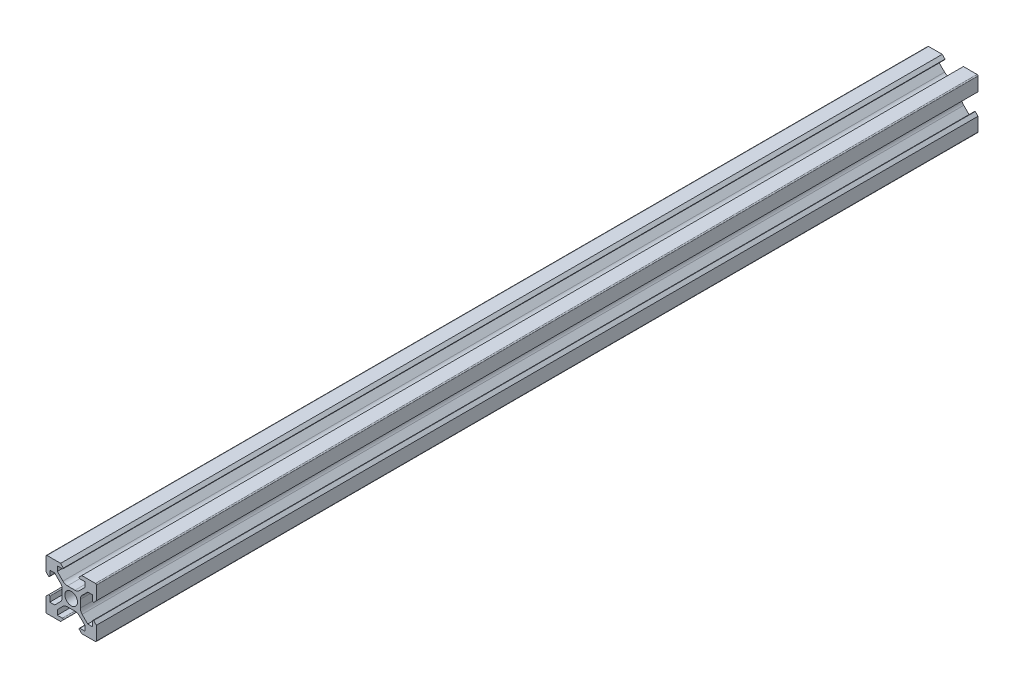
ISO-10303-21;
HEADER;
FILE_DESCRIPTION(('STEP AP214'),'2;1');
FILE_NAME('part.step','',(''),(''),'','','');
FILE_SCHEMA(('AUTOMOTIVE_DESIGN { 1 0 10303 214 1 1 1 1 }'));
ENDSEC;
DATA;
#1=APPLICATION_CONTEXT('core data for automotive mechanical design processes');
#2=APPLICATION_PROTOCOL_DEFINITION('international standard','automotive_design',2000,#1);
#3=PRODUCT_CONTEXT('',#1,'mechanical');
#4=PRODUCT('Part','Part','',(#3));
#5=PRODUCT_RELATED_PRODUCT_CATEGORY('part','',(#4));
#6=PRODUCT_DEFINITION_FORMATION('','',#4);
#7=PRODUCT_DEFINITION_CONTEXT('part definition',#1,'design');
#8=PRODUCT_DEFINITION('design','',#6,#7);
#9=PRODUCT_DEFINITION_SHAPE('','',#8);
#10=(LENGTH_UNIT() NAMED_UNIT(*) SI_UNIT(.MILLI.,.METRE.));
#11=(NAMED_UNIT(*) PLANE_ANGLE_UNIT() SI_UNIT($,.RADIAN.));
#12=(NAMED_UNIT(*) SI_UNIT($,.STERADIAN.) SOLID_ANGLE_UNIT());
#13=UNCERTAINTY_MEASURE_WITH_UNIT(LENGTH_MEASURE(1.E-05),#10,'distance_accuracy_value','');
#14=(GEOMETRIC_REPRESENTATION_CONTEXT(3) GLOBAL_UNCERTAINTY_ASSIGNED_CONTEXT((#13)) GLOBAL_UNIT_ASSIGNED_CONTEXT((#10,
#11,#12)) REPRESENTATION_CONTEXT('',''));
#15=CARTESIAN_POINT('',(0.,0.,0.));
#16=DIRECTION('',(0.,0.,1.));
#17=DIRECTION('',(1.,0.,0.));
#18=AXIS2_PLACEMENT_3D('',#15,#16,#17);
#19=CARTESIAN_POINT('',(-3.49999999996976,8.8999999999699,231.));
#20=DIRECTION('',(0.,0.,-1.));
#21=DIRECTION('',(-1.,0.,0.));
#22=AXIS2_PLACEMENT_3D('',#19,#20,#21);
#23=CYLINDRICAL_SURFACE('',#22,0.4);
#24=CARTESIAN_POINT('',(-3.49999999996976,8.8999999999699,231.));
#25=DIRECTION('',(0.,0.,-1.));
#26=DIRECTION('',(-1.,0.,0.));
#27=AXIS2_PLACEMENT_3D('',#24,#25,#26);
#28=CIRCLE('',#27,0.4);
#29=CARTESIAN_POINT('',(-3.09999999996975,8.89999999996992,231.));
#30=VERTEX_POINT('',#29);
#31=CARTESIAN_POINT('',(-3.4999999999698,8.49999999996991,231.));
#32=VERTEX_POINT('',#31);
#33=EDGE_CURVE('E960',#30,#32,#28,.T.);
#34=ORIENTED_EDGE('',*,*,#33,.T.);
#35=DIRECTION('',(0.,0.,1.));
#36=VECTOR('',#35,1.);
#37=CARTESIAN_POINT('',(-3.49999999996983,8.49999999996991,231.));
#38=LINE('',#37,#36);
#39=CARTESIAN_POINT('',(-3.4999999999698,8.49999999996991,-119.));
#40=VERTEX_POINT('',#39);
#41=EDGE_CURVE('E802',#32,#40,#38,.F.);
#42=ORIENTED_EDGE('',*,*,#41,.T.);
#43=CARTESIAN_POINT('',(-3.49999999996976,8.8999999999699,-119.));
#44=DIRECTION('',(0.,0.,-1.));
#45=DIRECTION('',(-1.,0.,0.));
#46=AXIS2_PLACEMENT_3D('',#43,#44,#45);
#47=CIRCLE('',#46,0.4);
#48=CARTESIAN_POINT('',(-3.09999999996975,8.89999999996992,-119.));
#49=VERTEX_POINT('',#48);
#50=EDGE_CURVE('E20',#40,#49,#47,.F.);
#51=ORIENTED_EDGE('',*,*,#50,.T.);
#52=DIRECTION('',(0.,0.,1.));
#53=VECTOR('',#52,1.);
#54=CARTESIAN_POINT('',(-3.09999999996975,8.89999999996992,231.));
#55=LINE('',#54,#53);
#56=EDGE_CURVE('E931',#49,#30,#55,.T.);
#57=ORIENTED_EDGE('',*,*,#56,.T.);
#58=EDGE_LOOP('',(#34,#42,#51,#57));
#59=FACE_BOUND('',#58,.T.);
#60=ADVANCED_FACE('F17',(#59),#23,.T.);
#61=CARTESIAN_POINT('',(-3.09999999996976,8.89999999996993,231.));
#62=DIRECTION('',(-0.707106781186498,-0.707106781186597,0.));
#63=DIRECTION('',(0.707106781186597,-0.707106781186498,0.));
#64=AXIS2_PLACEMENT_3D('',#61,#62,#63);
#65=PLANE('',#64);
#66=DIRECTION('',(0.,0.,1.));
#67=VECTOR('',#66,1.);
#68=CARTESIAN_POINT('',(-4.2,9.99999999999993,231.));
#69=LINE('',#68,#67);
#70=CARTESIAN_POINT('',(-4.2,9.99999999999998,-119.));
#71=VERTEX_POINT('',#70);
#72=CARTESIAN_POINT('',(-4.2,9.99999999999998,231.));
#73=VERTEX_POINT('',#72);
#74=EDGE_CURVE('E799',#71,#73,#69,.T.);
#75=ORIENTED_EDGE('',*,*,#74,.T.);
#76=DIRECTION('',(0.707106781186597,-0.707106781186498,0.));
#77=VECTOR('',#76,1.);
#78=CARTESIAN_POINT('',(-3.09999999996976,8.89999999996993,231.));
#79=LINE('',#78,#77);
#80=EDGE_CURVE('E926',#30,#73,#79,.F.);
#81=ORIENTED_EDGE('',*,*,#80,.F.);
#82=ORIENTED_EDGE('',*,*,#56,.F.);
#83=DIRECTION('',(0.707106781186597,-0.707106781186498,0.));
#84=VECTOR('',#83,1.);
#85=CARTESIAN_POINT('',(-3.09999999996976,8.89999999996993,-119.));
#86=LINE('',#85,#84);
#87=EDGE_CURVE('E923',#71,#49,#86,.T.);
#88=ORIENTED_EDGE('',*,*,#87,.F.);
#89=EDGE_LOOP('',(#75,#81,#82,#88));
#90=FACE_BOUND('',#89,.T.);
#91=ADVANCED_FACE('F1025',(#90),#65,.F.);
#92=CARTESIAN_POINT('',(-9.6,9.6,231.));
#93=DIRECTION('',(0.,0.,-1.));
#94=DIRECTION('',(-1.,0.,0.));
#95=AXIS2_PLACEMENT_3D('',#92,#93,#94);
#96=CYLINDRICAL_SURFACE('',#95,0.400000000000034);
#97=CARTESIAN_POINT('',(-9.6,9.6,231.));
#98=DIRECTION('',(0.,0.,-1.));
#99=DIRECTION('',(-1.,0.,0.));
#100=AXIS2_PLACEMENT_3D('',#97,#98,#99);
#101=CIRCLE('',#100,0.400000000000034);
#102=CARTESIAN_POINT('',(-10.,9.60000000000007,231.));
#103=VERTEX_POINT('',#102);
#104=CARTESIAN_POINT('',(-9.6,10.,231.));
#105=VERTEX_POINT('',#104);
#106=EDGE_CURVE('E378',#103,#105,#101,.T.);
#107=ORIENTED_EDGE('',*,*,#106,.T.);
#108=DIRECTION('',(0.,0.,1.));
#109=VECTOR('',#108,1.);
#110=CARTESIAN_POINT('',(-9.6,10.,231.));
#111=LINE('',#110,#109);
#112=CARTESIAN_POINT('',(-9.6,10.,-119.));
#113=VERTEX_POINT('',#112);
#114=EDGE_CURVE('E793',#105,#113,#111,.F.);
#115=ORIENTED_EDGE('',*,*,#114,.T.);
#116=CARTESIAN_POINT('',(-9.6,9.6,-119.));
#117=DIRECTION('',(0.,0.,-1.));
#118=DIRECTION('',(-1.,0.,0.));
#119=AXIS2_PLACEMENT_3D('',#116,#117,#118);
#120=CIRCLE('',#119,0.400000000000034);
#121=CARTESIAN_POINT('',(-10.,9.60000000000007,-119.));
#122=VERTEX_POINT('',#121);
#123=EDGE_CURVE('E925',#113,#122,#120,.F.);
#124=ORIENTED_EDGE('',*,*,#123,.T.);
#125=DIRECTION('',(0.,0.,-1.));
#126=VECTOR('',#125,1.);
#127=CARTESIAN_POINT('',(-10.,9.60000000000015,231.));
#128=LINE('',#127,#126);
#129=EDGE_CURVE('E388',#122,#103,#128,.F.);
#130=ORIENTED_EDGE('',*,*,#129,.T.);
#131=EDGE_LOOP('',(#107,#115,#124,#130));
#132=FACE_BOUND('',#131,.T.);
#133=ADVANCED_FACE('F1868',(#132),#96,.T.);
#134=CARTESIAN_POINT('',(-8.89999999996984,3.09999999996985,231.));
#135=DIRECTION('',(0.70710678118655,0.707106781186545,0.));
#136=DIRECTION('',(-0.707106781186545,0.70710678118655,0.));
#137=AXIS2_PLACEMENT_3D('',#134,#135,#136);
#138=PLANE('',#137);
#139=DIRECTION('',(0.,0.,-1.));
#140=VECTOR('',#139,1.);
#141=CARTESIAN_POINT('',(-8.89999999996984,3.09999999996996,231.));
#142=LINE('',#141,#140);
#143=CARTESIAN_POINT('',(-8.89999999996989,3.09999999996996,231.));
#144=VERTEX_POINT('',#143);
#145=CARTESIAN_POINT('',(-8.89999999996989,3.09999999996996,-119.));
#146=VERTEX_POINT('',#145);
#147=EDGE_CURVE('E375',#144,#146,#142,.T.);
#148=ORIENTED_EDGE('',*,*,#147,.F.);
#149=DIRECTION('',(-0.707106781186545,0.70710678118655,0.));
#150=VECTOR('',#149,1.);
#151=CARTESIAN_POINT('',(-8.89999999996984,3.09999999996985,231.));
#152=LINE('',#151,#150);
#153=CARTESIAN_POINT('',(-10.,4.2,231.));
#154=VERTEX_POINT('',#153);
#155=EDGE_CURVE('E369',#154,#144,#152,.F.);
#156=ORIENTED_EDGE('',*,*,#155,.F.);
#157=DIRECTION('',(0.,0.,-1.));
#158=VECTOR('',#157,1.);
#159=CARTESIAN_POINT('',(-10.,4.2,231.));
#160=LINE('',#159,#158);
#161=CARTESIAN_POINT('',(-10.,4.2,-119.));
#162=VERTEX_POINT('',#161);
#163=EDGE_CURVE('E372',#154,#162,#160,.T.);
#164=ORIENTED_EDGE('',*,*,#163,.T.);
#165=DIRECTION('',(-0.707106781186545,0.70710678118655,0.));
#166=VECTOR('',#165,1.);
#167=CARTESIAN_POINT('',(-8.89999999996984,3.09999999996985,-119.));
#168=LINE('',#167,#166);
#169=EDGE_CURVE('E377',#146,#162,#168,.T.);
#170=ORIENTED_EDGE('',*,*,#169,.F.);
#171=EDGE_LOOP('',(#148,#156,#164,#170));
#172=FACE_BOUND('',#171,.T.);
#173=ADVANCED_FACE('F371',(#172),#138,.F.);
#174=CARTESIAN_POINT('',(-8.89999999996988,3.49999999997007,231.));
#175=DIRECTION('',(0.,0.,-1.));
#176=DIRECTION('',(-1.,0.,0.));
#177=AXIS2_PLACEMENT_3D('',#174,#175,#176);
#178=CYLINDRICAL_SURFACE('',#177,0.400000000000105);
#179=CARTESIAN_POINT('',(-8.89999999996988,3.49999999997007,231.));
#180=DIRECTION('',(0.,0.,-1.));
#181=DIRECTION('',(-1.,0.,0.));
#182=AXIS2_PLACEMENT_3D('',#179,#180,#181);
#183=CIRCLE('',#182,0.400000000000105);
#184=CARTESIAN_POINT('',(-8.49999999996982,3.49999999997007,231.));
#185=VERTEX_POINT('',#184);
#186=EDGE_CURVE('E958',#185,#144,#183,.T.);
#187=ORIENTED_EDGE('',*,*,#186,.T.);
#188=ORIENTED_EDGE('',*,*,#147,.T.);
#189=CARTESIAN_POINT('',(-8.89999999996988,3.49999999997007,-119.));
#190=DIRECTION('',(0.,0.,-1.));
#191=DIRECTION('',(-1.,0.,0.));
#192=AXIS2_PLACEMENT_3D('',#189,#190,#191);
#193=CIRCLE('',#192,0.400000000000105);
#194=CARTESIAN_POINT('',(-8.49999999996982,3.49999999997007,-119.));
#195=VERTEX_POINT('',#194);
#196=EDGE_CURVE('E920',#146,#195,#193,.F.);
#197=ORIENTED_EDGE('',*,*,#196,.T.);
#198=DIRECTION('',(0.,0.,1.));
#199=VECTOR('',#198,1.);
#200=CARTESIAN_POINT('',(-8.49999999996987,3.49999999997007,231.));
#201=LINE('',#200,#199);
#202=EDGE_CURVE('E387',#195,#185,#201,.T.);
#203=ORIENTED_EDGE('',*,*,#202,.T.);
#204=EDGE_LOOP('',(#187,#188,#197,#203));
#205=FACE_BOUND('',#204,.T.);
#206=ADVANCED_FACE('F1126',(#205),#178,.T.);
#207=CARTESIAN_POINT('',(-8.89999999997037,-3.49999999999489,231.));
#208=DIRECTION('',(0.,0.,-1.));
#209=DIRECTION('',(-1.,0.,0.));
#210=AXIS2_PLACEMENT_3D('',#207,#208,#209);
#211=CYLINDRICAL_SURFACE('',#210,0.399999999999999);
#212=CARTESIAN_POINT('',(-8.89999999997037,-3.49999999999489,231.));
#213=DIRECTION('',(0.,0.,-1.));
#214=DIRECTION('',(-1.,0.,0.));
#215=AXIS2_PLACEMENT_3D('',#212,#213,#214);
#216=CIRCLE('',#215,0.399999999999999);
#217=CARTESIAN_POINT('',(-8.8999999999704,-3.09999999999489,231.));
#218=VERTEX_POINT('',#217);
#219=CARTESIAN_POINT('',(-8.49999999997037,-3.49999999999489,231.));
#220=VERTEX_POINT('',#219);
#221=EDGE_CURVE('E955',#218,#220,#216,.T.);
#222=ORIENTED_EDGE('',*,*,#221,.T.);
#223=DIRECTION('',(0.,0.,1.));
#224=VECTOR('',#223,1.);
#225=CARTESIAN_POINT('',(-8.49999999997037,-3.49999999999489,231.));
#226=LINE('',#225,#224);
#227=CARTESIAN_POINT('',(-8.49999999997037,-3.49999999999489,-119.));
#228=VERTEX_POINT('',#227);
#229=EDGE_CURVE('E742',#220,#228,#226,.F.);
#230=ORIENTED_EDGE('',*,*,#229,.T.);
#231=CARTESIAN_POINT('',(-8.89999999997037,-3.49999999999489,-119.));
#232=DIRECTION('',(0.,0.,-1.));
#233=DIRECTION('',(-1.,0.,0.));
#234=AXIS2_PLACEMENT_3D('',#231,#232,#233);
#235=CIRCLE('',#234,0.399999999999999);
#236=CARTESIAN_POINT('',(-8.8999999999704,-3.09999999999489,-119.));
#237=VERTEX_POINT('',#236);
#238=EDGE_CURVE('E957',#228,#237,#235,.F.);
#239=ORIENTED_EDGE('',*,*,#238,.T.);
#240=DIRECTION('',(0.,0.,1.));
#241=VECTOR('',#240,1.);
#242=CARTESIAN_POINT('',(-8.8999999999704,-3.09999999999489,231.));
#243=LINE('',#242,#241);
#244=EDGE_CURVE('E914',#237,#218,#243,.T.);
#245=ORIENTED_EDGE('',*,*,#244,.T.);
#246=EDGE_LOOP('',(#222,#230,#239,#245));
#247=FACE_BOUND('',#246,.T.);
#248=ADVANCED_FACE('F1362',(#247),#211,.T.);
#249=CARTESIAN_POINT('',(-8.8999999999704,-3.09999999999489,231.));
#250=DIRECTION('',(0.707106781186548,-0.707106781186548,0.));
#251=DIRECTION('',(0.707106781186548,0.707106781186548,0.));
#252=AXIS2_PLACEMENT_3D('',#249,#250,#251);
#253=PLANE('',#252);
#254=DIRECTION('',(0.,0.,-1.));
#255=VECTOR('',#254,1.);
#256=CARTESIAN_POINT('',(-10.0000000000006,-4.20000000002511,231.));
#257=LINE('',#256,#255);
#258=CARTESIAN_POINT('',(-10.0000000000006,-4.20000000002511,-119.));
#259=VERTEX_POINT('',#258);
#260=CARTESIAN_POINT('',(-10.0000000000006,-4.20000000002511,231.));
#261=VERTEX_POINT('',#260);
#262=EDGE_CURVE('E739',#259,#261,#257,.F.);
#263=ORIENTED_EDGE('',*,*,#262,.T.);
#264=DIRECTION('',(0.707106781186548,0.707106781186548,0.));
#265=VECTOR('',#264,1.);
#266=CARTESIAN_POINT('',(-8.8999999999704,-3.09999999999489,231.));
#267=LINE('',#266,#265);
#268=EDGE_CURVE('E910',#218,#261,#267,.F.);
#269=ORIENTED_EDGE('',*,*,#268,.F.);
#270=ORIENTED_EDGE('',*,*,#244,.F.);
#271=DIRECTION('',(0.707106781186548,0.707106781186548,0.));
#272=VECTOR('',#271,1.);
#273=CARTESIAN_POINT('',(-8.8999999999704,-3.09999999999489,-119.));
#274=LINE('',#273,#272);
#275=EDGE_CURVE('E906',#259,#237,#274,.T.);
#276=ORIENTED_EDGE('',*,*,#275,.F.);
#277=EDGE_LOOP('',(#263,#269,#270,#276));
#278=FACE_BOUND('',#277,.T.);
#279=ADVANCED_FACE('F1356',(#278),#253,.F.);
#280=CARTESIAN_POINT('',(-9.60000000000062,-9.60000000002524,231.));
#281=DIRECTION('',(0.,0.,-1.));
#282=DIRECTION('',(-1.,0.,0.));
#283=AXIS2_PLACEMENT_3D('',#280,#281,#282);
#284=CYLINDRICAL_SURFACE('',#283,0.399999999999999);
#285=CARTESIAN_POINT('',(-9.60000000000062,-9.60000000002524,231.));
#286=DIRECTION('',(0.,0.,-1.));
#287=DIRECTION('',(-1.,0.,0.));
#288=AXIS2_PLACEMENT_3D('',#285,#286,#287);
#289=CIRCLE('',#288,0.399999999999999);
#290=CARTESIAN_POINT('',(-9.60000000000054,-10.0000000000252,231.));
#291=VERTEX_POINT('',#290);
#292=CARTESIAN_POINT('',(-10.0000000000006,-9.60000000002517,231.));
#293=VERTEX_POINT('',#292);
#294=EDGE_CURVE('E899',#291,#293,#289,.T.);
#295=ORIENTED_EDGE('',*,*,#294,.T.);
#296=DIRECTION('',(0.,0.,-1.));
#297=VECTOR('',#296,1.);
#298=CARTESIAN_POINT('',(-10.0000000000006,-9.60000000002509,231.));
#299=LINE('',#298,#297);
#300=CARTESIAN_POINT('',(-10.0000000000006,-9.60000000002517,-119.));
#301=VERTEX_POINT('',#300);
#302=EDGE_CURVE('E732',#293,#301,#299,.T.);
#303=ORIENTED_EDGE('',*,*,#302,.T.);
#304=CARTESIAN_POINT('',(-9.60000000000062,-9.60000000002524,-119.));
#305=DIRECTION('',(0.,0.,-1.));
#306=DIRECTION('',(-1.,0.,0.));
#307=AXIS2_PLACEMENT_3D('',#304,#305,#306);
#308=CIRCLE('',#307,0.399999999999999);
#309=CARTESIAN_POINT('',(-9.60000000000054,-10.0000000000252,-119.));
#310=VERTEX_POINT('',#309);
#311=EDGE_CURVE('E909',#301,#310,#308,.F.);
#312=ORIENTED_EDGE('',*,*,#311,.T.);
#313=DIRECTION('',(0.,0.,1.));
#314=VECTOR('',#313,1.);
#315=CARTESIAN_POINT('',(-9.60000000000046,-10.0000000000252,231.));
#316=LINE('',#315,#314);
#317=EDGE_CURVE('E729',#310,#291,#316,.T.);
#318=ORIENTED_EDGE('',*,*,#317,.T.);
#319=EDGE_LOOP('',(#295,#303,#312,#318));
#320=FACE_BOUND('',#319,.T.);
#321=ADVANCED_FACE('F1349',(#320),#284,.T.);
#322=CARTESIAN_POINT('',(-3.09999999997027,-8.89999999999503,231.));
#323=DIRECTION('',(-0.707106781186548,0.707106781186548,0.));
#324=DIRECTION('',(-0.707106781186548,-0.707106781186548,0.));
#325=AXIS2_PLACEMENT_3D('',#322,#323,#324);
#326=PLANE('',#325);
#327=DIRECTION('',(0.,0.,-1.));
#328=VECTOR('',#327,1.);
#329=CARTESIAN_POINT('',(-3.09999999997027,-8.89999999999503,231.));
#330=LINE('',#329,#328);
#331=CARTESIAN_POINT('',(-3.09999999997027,-8.89999999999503,231.));
#332=VERTEX_POINT('',#331);
#333=CARTESIAN_POINT('',(-3.09999999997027,-8.89999999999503,-119.));
#334=VERTEX_POINT('',#333);
#335=EDGE_CURVE('E948',#332,#334,#330,.T.);
#336=ORIENTED_EDGE('',*,*,#335,.F.);
#337=DIRECTION('',(-0.707106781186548,-0.707106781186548,0.));
#338=VECTOR('',#337,1.);
#339=CARTESIAN_POINT('',(-3.09999999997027,-8.89999999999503,231.));
#340=LINE('',#339,#338);
#341=CARTESIAN_POINT('',(-4.20000000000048,-10.0000000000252,231.));
#342=VERTEX_POINT('',#341);
#343=EDGE_CURVE('E895',#342,#332,#340,.F.);
#344=ORIENTED_EDGE('',*,*,#343,.F.);
#345=DIRECTION('',(0.,0.,1.));
#346=VECTOR('',#345,1.);
#347=CARTESIAN_POINT('',(-4.20000000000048,-10.0000000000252,231.));
#348=LINE('',#347,#346);
#349=CARTESIAN_POINT('',(-4.20000000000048,-10.0000000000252,-119.));
#350=VERTEX_POINT('',#349);
#351=EDGE_CURVE('E728',#342,#350,#348,.F.);
#352=ORIENTED_EDGE('',*,*,#351,.T.);
#353=DIRECTION('',(-0.707106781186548,-0.707106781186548,0.));
#354=VECTOR('',#353,1.);
#355=CARTESIAN_POINT('',(-3.09999999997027,-8.89999999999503,-119.));
#356=LINE('',#355,#354);
#357=EDGE_CURVE('E898',#334,#350,#356,.T.);
#358=ORIENTED_EDGE('',*,*,#357,.F.);
#359=EDGE_LOOP('',(#336,#344,#352,#358));
#360=FACE_BOUND('',#359,.T.);
#361=ADVANCED_FACE('F1340',(#360),#326,.F.);
#362=CARTESIAN_POINT('',(-3.49999999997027,-8.89999999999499,231.));
#363=DIRECTION('',(0.,0.,-1.));
#364=DIRECTION('',(-1.,0.,0.));
#365=AXIS2_PLACEMENT_3D('',#362,#363,#364);
#366=CYLINDRICAL_SURFACE('',#365,0.4);
#367=CARTESIAN_POINT('',(-3.49999999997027,-8.89999999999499,231.));
#368=DIRECTION('',(0.,0.,-1.));
#369=DIRECTION('',(-1.,0.,0.));
#370=AXIS2_PLACEMENT_3D('',#367,#368,#369);
#371=CIRCLE('',#370,0.4);
#372=CARTESIAN_POINT('',(-3.49999999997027,-8.49999999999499,231.));
#373=VERTEX_POINT('',#372);
#374=EDGE_CURVE('E952',#373,#332,#371,.T.);
#375=ORIENTED_EDGE('',*,*,#374,.T.);
#376=ORIENTED_EDGE('',*,*,#335,.T.);
#377=CARTESIAN_POINT('',(-3.49999999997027,-8.89999999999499,-119.));
#378=DIRECTION('',(0.,0.,-1.));
#379=DIRECTION('',(-1.,0.,0.));
#380=AXIS2_PLACEMENT_3D('',#377,#378,#379);
#381=CIRCLE('',#380,0.4);
#382=CARTESIAN_POINT('',(-3.49999999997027,-8.49999999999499,-119.));
#383=VERTEX_POINT('',#382);
#384=EDGE_CURVE('E903',#334,#383,#381,.F.);
#385=ORIENTED_EDGE('',*,*,#384,.T.);
#386=DIRECTION('',(0.,0.,-1.));
#387=VECTOR('',#386,1.);
#388=CARTESIAN_POINT('',(-3.49999999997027,-8.49999999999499,231.));
#389=LINE('',#388,#387);
#390=EDGE_CURVE('E723',#383,#373,#389,.F.);
#391=ORIENTED_EDGE('',*,*,#390,.T.);
#392=EDGE_LOOP('',(#375,#376,#385,#391));
#393=FACE_BOUND('',#392,.T.);
#394=ADVANCED_FACE('F1337',(#393),#366,.T.);
#395=CARTESIAN_POINT('',(3.50000000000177,-8.89999999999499,231.));
#396=DIRECTION('',(0.,0.,-1.));
#397=DIRECTION('',(-1.,0.,0.));
#398=AXIS2_PLACEMENT_3D('',#395,#396,#397);
#399=CYLINDRICAL_SURFACE('',#398,0.4);
#400=CARTESIAN_POINT('',(3.50000000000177,-8.89999999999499,231.));
#401=DIRECTION('',(0.,0.,-1.));
#402=DIRECTION('',(-1.,0.,0.));
#403=AXIS2_PLACEMENT_3D('',#400,#401,#402);
#404=CIRCLE('',#403,0.4);
#405=CARTESIAN_POINT('',(3.10000000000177,-8.89999999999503,231.));
#406=VERTEX_POINT('',#405);
#407=CARTESIAN_POINT('',(3.50000000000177,-8.49999999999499,231.));
#408=VERTEX_POINT('',#407);
#409=EDGE_CURVE('E947',#406,#408,#404,.T.);
#410=ORIENTED_EDGE('',*,*,#409,.T.);
#411=DIRECTION('',(0.,0.,1.));
#412=VECTOR('',#411,1.);
#413=CARTESIAN_POINT('',(3.50000000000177,-8.49999999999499,231.));
#414=LINE('',#413,#412);
#415=CARTESIAN_POINT('',(3.50000000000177,-8.49999999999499,-119.));
#416=VERTEX_POINT('',#415);
#417=EDGE_CURVE('E674',#408,#416,#414,.F.);
#418=ORIENTED_EDGE('',*,*,#417,.T.);
#419=CARTESIAN_POINT('',(3.50000000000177,-8.89999999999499,-119.));
#420=DIRECTION('',(0.,0.,-1.));
#421=DIRECTION('',(-1.,0.,0.));
#422=AXIS2_PLACEMENT_3D('',#419,#420,#421);
#423=CIRCLE('',#422,0.4);
#424=CARTESIAN_POINT('',(3.10000000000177,-8.89999999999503,-119.));
#425=VERTEX_POINT('',#424);
#426=EDGE_CURVE('E951',#416,#425,#423,.F.);
#427=ORIENTED_EDGE('',*,*,#426,.T.);
#428=DIRECTION('',(0.,0.,1.));
#429=VECTOR('',#428,1.);
#430=CARTESIAN_POINT('',(3.10000000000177,-8.89999999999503,231.));
#431=LINE('',#430,#429);
#432=EDGE_CURVE('E892',#425,#406,#431,.T.);
#433=ORIENTED_EDGE('',*,*,#432,.T.);
#434=EDGE_LOOP('',(#410,#418,#427,#433));
#435=FACE_BOUND('',#434,.T.);
#436=ADVANCED_FACE('F1296',(#435),#399,.T.);
#437=CARTESIAN_POINT('',(3.10000000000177,-8.89999999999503,231.));
#438=DIRECTION('',(0.707106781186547,0.707106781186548,0.));
#439=DIRECTION('',(-0.707106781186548,0.707106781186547,0.));
#440=AXIS2_PLACEMENT_3D('',#437,#438,#439);
#441=PLANE('',#440);
#442=DIRECTION('',(0.,0.,1.));
#443=VECTOR('',#442,1.);
#444=CARTESIAN_POINT('',(4.20000000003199,-10.0000000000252,231.));
#445=LINE('',#444,#443);
#446=CARTESIAN_POINT('',(4.20000000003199,-10.0000000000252,-119.));
#447=VERTEX_POINT('',#446);
#448=CARTESIAN_POINT('',(4.20000000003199,-10.0000000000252,231.));
#449=VERTEX_POINT('',#448);
#450=EDGE_CURVE('E671',#447,#449,#445,.T.);
#451=ORIENTED_EDGE('',*,*,#450,.T.);
#452=DIRECTION('',(-0.707106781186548,0.707106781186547,0.));
#453=VECTOR('',#452,1.);
#454=CARTESIAN_POINT('',(3.10000000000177,-8.89999999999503,231.));
#455=LINE('',#454,#453);
#456=EDGE_CURVE('E888',#406,#449,#455,.F.);
#457=ORIENTED_EDGE('',*,*,#456,.F.);
#458=ORIENTED_EDGE('',*,*,#432,.F.);
#459=DIRECTION('',(-0.707106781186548,0.707106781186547,0.));
#460=VECTOR('',#459,1.);
#461=CARTESIAN_POINT('',(3.10000000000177,-8.89999999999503,-119.));
#462=LINE('',#461,#460);
#463=EDGE_CURVE('E884',#447,#425,#462,.T.);
#464=ORIENTED_EDGE('',*,*,#463,.F.);
#465=EDGE_LOOP('',(#451,#457,#458,#464));
#466=FACE_BOUND('',#465,.T.);
#467=ADVANCED_FACE('F1293',(#466),#441,.F.);
#468=CARTESIAN_POINT('',(9.60000000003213,-9.60000000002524,231.));
#469=DIRECTION('',(0.,0.,-1.));
#470=DIRECTION('',(-1.,0.,0.));
#471=AXIS2_PLACEMENT_3D('',#468,#469,#470);
#472=CYLINDRICAL_SURFACE('',#471,0.399999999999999);
#473=CARTESIAN_POINT('',(9.60000000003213,-9.60000000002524,231.));
#474=DIRECTION('',(0.,0.,-1.));
#475=DIRECTION('',(-1.,0.,0.));
#476=AXIS2_PLACEMENT_3D('',#473,#474,#475);
#477=CIRCLE('',#476,0.399999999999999);
#478=CARTESIAN_POINT('',(10.0000000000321,-9.60000000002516,231.));
#479=VERTEX_POINT('',#478);
#480=CARTESIAN_POINT('',(9.60000000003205,-10.0000000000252,231.));
#481=VERTEX_POINT('',#480);
#482=EDGE_CURVE('E877',#479,#481,#477,.T.);
#483=ORIENTED_EDGE('',*,*,#482,.T.);
#484=DIRECTION('',(0.,0.,1.));
#485=VECTOR('',#484,1.);
#486=CARTESIAN_POINT('',(9.60000000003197,-10.0000000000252,231.));
#487=LINE('',#486,#485);
#488=CARTESIAN_POINT('',(9.60000000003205,-10.0000000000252,-119.));
#489=VERTEX_POINT('',#488);
#490=EDGE_CURVE('E664',#481,#489,#487,.F.);
#491=ORIENTED_EDGE('',*,*,#490,.T.);
#492=CARTESIAN_POINT('',(9.60000000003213,-9.60000000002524,-119.));
#493=DIRECTION('',(0.,0.,-1.));
#494=DIRECTION('',(-1.,0.,0.));
#495=AXIS2_PLACEMENT_3D('',#492,#493,#494);
#496=CIRCLE('',#495,0.399999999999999);
#497=CARTESIAN_POINT('',(10.0000000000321,-9.60000000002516,-119.));
#498=VERTEX_POINT('',#497);
#499=EDGE_CURVE('E887',#489,#498,#496,.F.);
#500=ORIENTED_EDGE('',*,*,#499,.T.);
#501=DIRECTION('',(0.,0.,1.));
#502=VECTOR('',#501,1.);
#503=CARTESIAN_POINT('',(10.0000000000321,-9.60000000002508,231.));
#504=LINE('',#503,#502);
#505=EDGE_CURVE('E661',#498,#479,#504,.T.);
#506=ORIENTED_EDGE('',*,*,#505,.T.);
#507=EDGE_LOOP('',(#483,#491,#500,#506));
#508=FACE_BOUND('',#507,.T.);
#509=ADVANCED_FACE('F1284',(#508),#472,.T.);
#510=CARTESIAN_POINT('',(8.9000000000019,-3.09999999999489,231.));
#511=DIRECTION('',(-0.707106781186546,-0.707106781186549,0.));
#512=DIRECTION('',(0.707106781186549,-0.707106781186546,0.));
#513=AXIS2_PLACEMENT_3D('',#510,#511,#512);
#514=PLANE('',#513);
#515=DIRECTION('',(0.,0.,-1.));
#516=VECTOR('',#515,1.);
#517=CARTESIAN_POINT('',(8.9000000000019,-3.09999999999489,231.));
#518=LINE('',#517,#516);
#519=CARTESIAN_POINT('',(8.9000000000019,-3.09999999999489,231.));
#520=VERTEX_POINT('',#519);
#521=CARTESIAN_POINT('',(8.9000000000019,-3.09999999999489,-119.));
#522=VERTEX_POINT('',#521);
#523=EDGE_CURVE('E940',#520,#522,#518,.T.);
#524=ORIENTED_EDGE('',*,*,#523,.F.);
#525=DIRECTION('',(0.707106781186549,-0.707106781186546,0.));
#526=VECTOR('',#525,1.);
#527=CARTESIAN_POINT('',(8.9000000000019,-3.09999999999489,231.));
#528=LINE('',#527,#526);
#529=CARTESIAN_POINT('',(10.0000000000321,-4.2000000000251,231.));
#530=VERTEX_POINT('',#529);
#531=EDGE_CURVE('E873',#530,#520,#528,.F.);
#532=ORIENTED_EDGE('',*,*,#531,.F.);
#533=DIRECTION('',(0.,0.,1.));
#534=VECTOR('',#533,1.);
#535=CARTESIAN_POINT('',(10.0000000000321,-4.2000000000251,231.));
#536=LINE('',#535,#534);
#537=CARTESIAN_POINT('',(10.0000000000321,-4.2000000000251,-119.));
#538=VERTEX_POINT('',#537);
#539=EDGE_CURVE('E660',#530,#538,#536,.F.);
#540=ORIENTED_EDGE('',*,*,#539,.T.);
#541=DIRECTION('',(0.707106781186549,-0.707106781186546,0.));
#542=VECTOR('',#541,1.);
#543=CARTESIAN_POINT('',(8.9000000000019,-3.09999999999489,-119.));
#544=LINE('',#543,#542);
#545=EDGE_CURVE('E876',#522,#538,#544,.T.);
#546=ORIENTED_EDGE('',*,*,#545,.F.);
#547=EDGE_LOOP('',(#524,#532,#540,#546));
#548=FACE_BOUND('',#547,.T.);
#549=ADVANCED_FACE('F1278',(#548),#514,.F.);
#550=CARTESIAN_POINT('',(8.90000000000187,-3.49999999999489,231.));
#551=DIRECTION('',(0.,0.,-1.));
#552=DIRECTION('',(-1.,0.,0.));
#553=AXIS2_PLACEMENT_3D('',#550,#551,#552);
#554=CYLINDRICAL_SURFACE('',#553,0.399999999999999);
#555=CARTESIAN_POINT('',(8.90000000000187,-3.49999999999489,231.));
#556=DIRECTION('',(0.,0.,-1.));
#557=DIRECTION('',(-1.,0.,0.));
#558=AXIS2_PLACEMENT_3D('',#555,#556,#557);
#559=CIRCLE('',#558,0.399999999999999);
#560=CARTESIAN_POINT('',(8.50000000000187,-3.49999999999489,231.));
#561=VERTEX_POINT('',#560);
#562=EDGE_CURVE('E944',#561,#520,#559,.T.);
#563=ORIENTED_EDGE('',*,*,#562,.T.);
#564=ORIENTED_EDGE('',*,*,#523,.T.);
#565=CARTESIAN_POINT('',(8.90000000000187,-3.49999999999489,-119.));
#566=DIRECTION('',(0.,0.,-1.));
#567=DIRECTION('',(-1.,0.,0.));
#568=AXIS2_PLACEMENT_3D('',#565,#566,#567);
#569=CIRCLE('',#568,0.399999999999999);
#570=CARTESIAN_POINT('',(8.50000000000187,-3.49999999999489,-119.));
#571=VERTEX_POINT('',#570);
#572=EDGE_CURVE('E881',#522,#571,#569,.F.);
#573=ORIENTED_EDGE('',*,*,#572,.T.);
#574=DIRECTION('',(0.,0.,-1.));
#575=VECTOR('',#574,1.);
#576=CARTESIAN_POINT('',(8.50000000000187,-3.49999999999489,231.));
#577=LINE('',#576,#575);
#578=EDGE_CURVE('E655',#571,#561,#577,.F.);
#579=ORIENTED_EDGE('',*,*,#578,.T.);
#580=EDGE_LOOP('',(#563,#564,#573,#579));
#581=FACE_BOUND('',#580,.T.);
#582=ADVANCED_FACE('F1273',(#581),#554,.T.);
#583=CARTESIAN_POINT('',(8.90000000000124,3.49999999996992,231.));
#584=DIRECTION('',(0.,0.,-1.));
#585=DIRECTION('',(-1.,0.,0.));
#586=AXIS2_PLACEMENT_3D('',#583,#584,#585);
#587=CYLINDRICAL_SURFACE('',#586,0.399999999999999);
#588=CARTESIAN_POINT('',(8.90000000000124,3.49999999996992,231.));
#589=DIRECTION('',(0.,0.,-1.));
#590=DIRECTION('',(-1.,0.,0.));
#591=AXIS2_PLACEMENT_3D('',#588,#589,#590);
#592=CIRCLE('',#591,0.399999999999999);
#593=CARTESIAN_POINT('',(8.90000000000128,3.09999999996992,231.));
#594=VERTEX_POINT('',#593);
#595=CARTESIAN_POINT('',(8.50000000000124,3.49999999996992,231.));
#596=VERTEX_POINT('',#595);
#597=EDGE_CURVE('E939',#594,#596,#592,.T.);
#598=ORIENTED_EDGE('',*,*,#597,.T.);
#599=DIRECTION('',(0.,0.,-1.));
#600=VECTOR('',#599,1.);
#601=CARTESIAN_POINT('',(8.50000000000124,3.49999999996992,231.));
#602=LINE('',#601,#600);
#603=CARTESIAN_POINT('',(8.50000000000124,3.49999999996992,-119.));
#604=VERTEX_POINT('',#603);
#605=EDGE_CURVE('E606',#596,#604,#602,.T.);
#606=ORIENTED_EDGE('',*,*,#605,.T.);
#607=CARTESIAN_POINT('',(8.90000000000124,3.49999999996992,-119.));
#608=DIRECTION('',(0.,0.,-1.));
#609=DIRECTION('',(-1.,0.,0.));
#610=AXIS2_PLACEMENT_3D('',#607,#608,#609);
#611=CIRCLE('',#610,0.399999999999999);
#612=CARTESIAN_POINT('',(8.90000000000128,3.09999999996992,-119.));
#613=VERTEX_POINT('',#612);
#614=EDGE_CURVE('E943',#604,#613,#611,.F.);
#615=ORIENTED_EDGE('',*,*,#614,.T.);
#616=DIRECTION('',(0.,0.,1.));
#617=VECTOR('',#616,1.);
#618=CARTESIAN_POINT('',(8.90000000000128,3.09999999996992,231.));
#619=LINE('',#618,#617);
#620=EDGE_CURVE('E870',#613,#594,#619,.T.);
#621=ORIENTED_EDGE('',*,*,#620,.T.);
#622=EDGE_LOOP('',(#598,#606,#615,#621));
#623=FACE_BOUND('',#622,.T.);
#624=ADVANCED_FACE('F1235',(#623),#587,.T.);
#625=CARTESIAN_POINT('',(8.90000000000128,3.09999999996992,231.));
#626=DIRECTION('',(-0.707106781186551,0.707106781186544,0.));
#627=DIRECTION('',(-0.707106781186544,-0.707106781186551,0.));
#628=AXIS2_PLACEMENT_3D('',#625,#626,#627);
#629=PLANE('',#628);
#630=DIRECTION('',(0.,0.,1.));
#631=VECTOR('',#630,1.);
#632=CARTESIAN_POINT('',(10.0000000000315,4.20000000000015,231.));
#633=LINE('',#632,#631);
#634=CARTESIAN_POINT('',(10.0000000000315,4.20000000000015,-119.));
#635=VERTEX_POINT('',#634);
#636=CARTESIAN_POINT('',(10.0000000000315,4.20000000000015,231.));
#637=VERTEX_POINT('',#636);
#638=EDGE_CURVE('E603',#635,#637,#633,.T.);
#639=ORIENTED_EDGE('',*,*,#638,.T.);
#640=DIRECTION('',(-0.707106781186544,-0.707106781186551,0.));
#641=VECTOR('',#640,1.);
#642=CARTESIAN_POINT('',(8.90000000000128,3.09999999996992,231.));
#643=LINE('',#642,#641);
#644=EDGE_CURVE('E866',#594,#637,#643,.F.);
#645=ORIENTED_EDGE('',*,*,#644,.F.);
#646=ORIENTED_EDGE('',*,*,#620,.F.);
#647=DIRECTION('',(-0.707106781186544,-0.707106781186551,0.));
#648=VECTOR('',#647,1.);
#649=CARTESIAN_POINT('',(8.90000000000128,3.09999999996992,-119.));
#650=LINE('',#649,#648);
#651=EDGE_CURVE('E862',#635,#613,#650,.T.);
#652=ORIENTED_EDGE('',*,*,#651,.F.);
#653=EDGE_LOOP('',(#639,#645,#646,#652));
#654=FACE_BOUND('',#653,.T.);
#655=ADVANCED_FACE('F1229',(#654),#629,.F.);
#656=CARTESIAN_POINT('',(9.60000000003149,9.60000000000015,231.));
#657=DIRECTION('',(0.,0.,-1.));
#658=DIRECTION('',(-1.,0.,0.));
#659=AXIS2_PLACEMENT_3D('',#656,#657,#658);
#660=CYLINDRICAL_SURFACE('',#659,0.399999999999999);
#661=CARTESIAN_POINT('',(9.60000000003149,9.60000000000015,231.));
#662=DIRECTION('',(0.,0.,-1.));
#663=DIRECTION('',(-1.,0.,0.));
#664=AXIS2_PLACEMENT_3D('',#661,#662,#663);
#665=CIRCLE('',#664,0.399999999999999);
#666=CARTESIAN_POINT('',(9.60000000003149,10.0000000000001,231.));
#667=VERTEX_POINT('',#666);
#668=CARTESIAN_POINT('',(10.0000000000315,9.60000000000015,231.));
#669=VERTEX_POINT('',#668);
#670=EDGE_CURVE('E855',#667,#669,#665,.T.);
#671=ORIENTED_EDGE('',*,*,#670,.T.);
#672=DIRECTION('',(0.,0.,1.));
#673=VECTOR('',#672,1.);
#674=CARTESIAN_POINT('',(10.0000000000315,9.60000000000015,231.));
#675=LINE('',#674,#673);
#676=CARTESIAN_POINT('',(10.0000000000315,9.60000000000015,-119.));
#677=VERTEX_POINT('',#676);
#678=EDGE_CURVE('E596',#669,#677,#675,.F.);
#679=ORIENTED_EDGE('',*,*,#678,.T.);
#680=CARTESIAN_POINT('',(9.60000000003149,9.60000000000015,-119.));
#681=DIRECTION('',(0.,0.,-1.));
#682=DIRECTION('',(-1.,0.,0.));
#683=AXIS2_PLACEMENT_3D('',#680,#681,#682);
#684=CIRCLE('',#683,0.399999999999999);
#685=CARTESIAN_POINT('',(9.60000000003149,10.0000000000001,-119.));
#686=VERTEX_POINT('',#685);
#687=EDGE_CURVE('E865',#677,#686,#684,.F.);
#688=ORIENTED_EDGE('',*,*,#687,.T.);
#689=DIRECTION('',(0.,0.,1.));
#690=VECTOR('',#689,1.);
#691=CARTESIAN_POINT('',(9.60000000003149,10.0000000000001,231.));
#692=LINE('',#691,#690);
#693=EDGE_CURVE('E593',#686,#667,#692,.T.);
#694=ORIENTED_EDGE('',*,*,#693,.T.);
#695=EDGE_LOOP('',(#671,#679,#688,#694));
#696=FACE_BOUND('',#695,.T.);
#697=ADVANCED_FACE('F1222',(#696),#660,.T.);
#698=CARTESIAN_POINT('',(3.10000000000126,8.89999999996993,231.));
#699=DIRECTION('',(0.707106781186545,-0.70710678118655,0.));
#700=DIRECTION('',(0.70710678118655,0.707106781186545,0.));
#701=AXIS2_PLACEMENT_3D('',#698,#699,#700);
#702=PLANE('',#701);
#703=DIRECTION('',(0.,0.,-1.));
#704=VECTOR('',#703,1.);
#705=CARTESIAN_POINT('',(3.10000000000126,8.8999999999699,231.));
#706=LINE('',#705,#704);
#707=CARTESIAN_POINT('',(3.10000000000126,8.89999999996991,231.));
#708=VERTEX_POINT('',#707);
#709=CARTESIAN_POINT('',(3.10000000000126,8.89999999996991,-119.));
#710=VERTEX_POINT('',#709);
#711=EDGE_CURVE('E816',#708,#710,#706,.T.);
#712=ORIENTED_EDGE('',*,*,#711,.F.);
#713=DIRECTION('',(0.70710678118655,0.707106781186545,0.));
#714=VECTOR('',#713,1.);
#715=CARTESIAN_POINT('',(3.10000000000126,8.89999999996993,231.));
#716=LINE('',#715,#714);
#717=CARTESIAN_POINT('',(4.20000000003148,10.0000000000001,231.));
#718=VERTEX_POINT('',#717);
#719=EDGE_CURVE('E851',#718,#708,#716,.F.);
#720=ORIENTED_EDGE('',*,*,#719,.F.);
#721=DIRECTION('',(0.,0.,1.));
#722=VECTOR('',#721,1.);
#723=CARTESIAN_POINT('',(4.20000000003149,10.0000000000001,231.));
#724=LINE('',#723,#722);
#725=CARTESIAN_POINT('',(4.20000000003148,10.0000000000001,-119.));
#726=VERTEX_POINT('',#725);
#727=EDGE_CURVE('E592',#718,#726,#724,.F.);
#728=ORIENTED_EDGE('',*,*,#727,.T.);
#729=DIRECTION('',(0.70710678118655,0.707106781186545,0.));
#730=VECTOR('',#729,1.);
#731=CARTESIAN_POINT('',(3.10000000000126,8.89999999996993,-119.));
#732=LINE('',#731,#730);
#733=EDGE_CURVE('E854',#710,#726,#732,.T.);
#734=ORIENTED_EDGE('',*,*,#733,.F.);
#735=EDGE_LOOP('',(#712,#720,#728,#734));
#736=FACE_BOUND('',#735,.T.);
#737=ADVANCED_FACE('F1215',(#736),#702,.F.);
#738=CARTESIAN_POINT('',(3.50000000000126,8.8999999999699,231.));
#739=DIRECTION('',(0.,0.,-1.));
#740=DIRECTION('',(-1.,0.,0.));
#741=AXIS2_PLACEMENT_3D('',#738,#739,#740);
#742=CYLINDRICAL_SURFACE('',#741,0.4);
#743=CARTESIAN_POINT('',(3.50000000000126,8.8999999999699,231.));
#744=DIRECTION('',(0.,0.,-1.));
#745=DIRECTION('',(-1.,0.,0.));
#746=AXIS2_PLACEMENT_3D('',#743,#744,#745);
#747=CIRCLE('',#746,0.4);
#748=CARTESIAN_POINT('',(3.50000000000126,8.4999999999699,231.));
#749=VERTEX_POINT('',#748);
#750=EDGE_CURVE('E936',#749,#708,#747,.T.);
#751=ORIENTED_EDGE('',*,*,#750,.T.);
#752=ORIENTED_EDGE('',*,*,#711,.T.);
#753=CARTESIAN_POINT('',(3.50000000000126,8.8999999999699,-119.));
#754=DIRECTION('',(0.,0.,-1.));
#755=DIRECTION('',(-1.,0.,0.));
#756=AXIS2_PLACEMENT_3D('',#753,#754,#755);
#757=CIRCLE('',#756,0.4);
#758=CARTESIAN_POINT('',(3.50000000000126,8.4999999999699,-119.));
#759=VERTEX_POINT('',#758);
#760=EDGE_CURVE('E859',#710,#759,#757,.F.);
#761=ORIENTED_EDGE('',*,*,#760,.T.);
#762=DIRECTION('',(0.,0.,1.));
#763=VECTOR('',#762,1.);
#764=CARTESIAN_POINT('',(3.50000000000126,8.4999999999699,231.));
#765=LINE('',#764,#763);
#766=EDGE_CURVE('E587',#759,#749,#765,.T.);
#767=ORIENTED_EDGE('',*,*,#766,.T.);
#768=EDGE_LOOP('',(#751,#752,#761,#767));
#769=FACE_BOUND('',#768,.T.);
#770=ADVANCED_FACE('F1218',(#769),#742,.T.);
#771=CARTESIAN_POINT('',(-5.49999999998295,6.56066017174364,231.));
#772=DIRECTION('',(-0.707106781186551,-0.707106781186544,0.));
#773=DIRECTION('',(0.707106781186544,-0.707106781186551,0.));
#774=AXIS2_PLACEMENT_3D('',#771,#772,#773);
#775=PLANE('',#774);
#776=DIRECTION('',(0.,0.,1.));
#777=VECTOR('',#776,1.);
#778=CARTESIAN_POINT('',(-5.49999999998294,6.56066017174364,231.));
#779=LINE('',#778,#777);
#780=CARTESIAN_POINT('',(-5.49999999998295,6.56066017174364,-119.));
#781=VERTEX_POINT('',#780);
#782=CARTESIAN_POINT('',(-5.49999999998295,6.56066017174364,231.));
#783=VERTEX_POINT('',#782);
#784=EDGE_CURVE('E807',#781,#783,#779,.T.);
#785=ORIENTED_EDGE('',*,*,#784,.T.);
#786=DIRECTION('',(-0.707106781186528,0.707106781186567,0.));
#787=VECTOR('',#786,1.);
#788=CARTESIAN_POINT('',(-3.27157287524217,4.33223304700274,231.));
#789=LINE('',#788,#787);
#790=CARTESIAN_POINT('',(-3.27157287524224,4.33223304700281,231.));
#791=VERTEX_POINT('',#790);
#792=EDGE_CURVE('E413',#791,#783,#789,.T.);
#793=ORIENTED_EDGE('',*,*,#792,.F.);
#794=DIRECTION('',(0.,0.,-1.));
#795=VECTOR('',#794,1.);
#796=CARTESIAN_POINT('',(-3.27157287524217,4.33223304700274,231.));
#797=LINE('',#796,#795);
#798=CARTESIAN_POINT('',(-3.27157287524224,4.33223304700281,-119.));
#799=VERTEX_POINT('',#798);
#800=EDGE_CURVE('E564',#791,#799,#797,.T.);
#801=ORIENTED_EDGE('',*,*,#800,.T.);
#802=DIRECTION('',(-0.707106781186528,0.707106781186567,0.));
#803=VECTOR('',#802,1.);
#804=CARTESIAN_POINT('',(-3.27157287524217,4.33223304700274,-119.));
#805=LINE('',#804,#803);
#806=EDGE_CURVE('E415',#799,#781,#805,.T.);
#807=ORIENTED_EDGE('',*,*,#806,.T.);
#808=EDGE_LOOP('',(#785,#793,#801,#807));
#809=FACE_BOUND('',#808,.T.);
#810=ADVANCED_FACE('F1042',(#809),#775,.F.);
#811=CARTESIAN_POINT('',(-5.49999999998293,8.49999999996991,231.));
#812=DIRECTION('',(-1.,0.,0.));
#813=DIRECTION('',(0.,-1.,0.));
#814=AXIS2_PLACEMENT_3D('',#811,#812,#813);
#815=PLANE('',#814);
#816=DIRECTION('',(0.,0.,1.));
#817=VECTOR('',#816,1.);
#818=CARTESIAN_POINT('',(-5.49999999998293,8.49999999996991,231.));
#819=LINE('',#818,#817);
#820=CARTESIAN_POINT('',(-5.49999999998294,8.49999999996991,-119.));
#821=VERTEX_POINT('',#820);
#822=CARTESIAN_POINT('',(-5.49999999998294,8.49999999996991,231.));
#823=VERTEX_POINT('',#822);
#824=EDGE_CURVE('E330',#821,#823,#819,.T.);
#825=ORIENTED_EDGE('',*,*,#824,.T.);
#826=DIRECTION('',(0.,1.,0.));
#827=VECTOR('',#826,1.);
#828=CARTESIAN_POINT('',(-5.49999999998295,6.09999999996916,231.));
#829=LINE('',#828,#827);
#830=EDGE_CURVE('E410',#783,#823,#829,.T.);
#831=ORIENTED_EDGE('',*,*,#830,.F.);
#832=ORIENTED_EDGE('',*,*,#784,.F.);
#833=DIRECTION('',(0.,1.,0.));
#834=VECTOR('',#833,1.);
#835=CARTESIAN_POINT('',(-5.49999999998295,6.09999999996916,-119.));
#836=LINE('',#835,#834);
#837=EDGE_CURVE('E559',#781,#821,#836,.T.);
#838=ORIENTED_EDGE('',*,*,#837,.T.);
#839=EDGE_LOOP('',(#825,#831,#832,#838));
#840=FACE_BOUND('',#839,.T.);
#841=ADVANCED_FACE('F1039',(#840),#815,.F.);
#842=CARTESIAN_POINT('',(-5.49999999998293,8.49999999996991,231.));
#843=DIRECTION('',(0.,1.,0.));
#844=DIRECTION('',(0.,0.,1.));
#845=AXIS2_PLACEMENT_3D('',#842,#843,#844);
#846=PLANE('',#845);
#847=ORIENTED_EDGE('',*,*,#41,.F.);
#848=DIRECTION('',(1.,0.,0.));
#849=VECTOR('',#848,1.);
#850=CARTESIAN_POINT('',(-1.50380592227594,8.49999999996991,231.));
#851=LINE('',#850,#849);
#852=EDGE_CURVE('E399',#823,#32,#851,.T.);
#853=ORIENTED_EDGE('',*,*,#852,.F.);
#854=ORIENTED_EDGE('',*,*,#824,.F.);
#855=DIRECTION('',(1.,0.,0.));
#856=VECTOR('',#855,1.);
#857=CARTESIAN_POINT('',(-1.50380592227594,8.49999999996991,-119.));
#858=LINE('',#857,#856);
#859=EDGE_CURVE('E555',#821,#40,#858,.T.);
#860=ORIENTED_EDGE('',*,*,#859,.T.);
#861=EDGE_LOOP('',(#847,#853,#854,#860));
#862=FACE_BOUND('',#861,.T.);
#863=ADVANCED_FACE('F1035',(#862),#846,.F.);
#864=CARTESIAN_POINT('',(-9.6,10.,231.));
#865=DIRECTION('',(0.,-1.,0.));
#866=DIRECTION('',(1.,0.,0.));
#867=AXIS2_PLACEMENT_3D('',#864,#865,#866);
#868=PLANE('',#867);
#869=ORIENTED_EDGE('',*,*,#114,.F.);
#870=DIRECTION('',(1.,0.,0.));
#871=VECTOR('',#870,1.);
#872=CARTESIAN_POINT('',(-1.50380592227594,10.,231.));
#873=LINE('',#872,#871);
#874=EDGE_CURVE('E394',#73,#105,#873,.F.);
#875=ORIENTED_EDGE('',*,*,#874,.F.);
#876=ORIENTED_EDGE('',*,*,#74,.F.);
#877=DIRECTION('',(1.,0.,0.));
#878=VECTOR('',#877,1.);
#879=CARTESIAN_POINT('',(-1.50380592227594,10.,-119.));
#880=LINE('',#879,#878);
#881=EDGE_CURVE('E550',#71,#113,#880,.F.);
#882=ORIENTED_EDGE('',*,*,#881,.T.);
#883=EDGE_LOOP('',(#869,#875,#876,#882));
#884=FACE_BOUND('',#883,.T.);
#885=ADVANCED_FACE('F1032',(#884),#868,.F.);
#886=CARTESIAN_POINT('',(-10.,9.60000000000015,231.));
#887=DIRECTION('',(1.,0.,0.));
#888=DIRECTION('',(0.,0.,-1.));
#889=AXIS2_PLACEMENT_3D('',#886,#887,#888);
#890=PLANE('',#889);
#891=ORIENTED_EDGE('',*,*,#163,.F.);
#892=DIRECTION('',(0.,1.,0.));
#893=VECTOR('',#892,1.);
#894=CARTESIAN_POINT('',(-10.,6.09999999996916,231.));
#895=LINE('',#894,#893);
#896=EDGE_CURVE('E384',#103,#154,#895,.F.);
#897=ORIENTED_EDGE('',*,*,#896,.F.);
#898=ORIENTED_EDGE('',*,*,#129,.F.);
#899=DIRECTION('',(0.,1.,0.));
#900=VECTOR('',#899,1.);
#901=CARTESIAN_POINT('',(-10.,6.09999999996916,-119.));
#902=LINE('',#901,#900);
#903=EDGE_CURVE('E386',#122,#162,#902,.F.);
#904=ORIENTED_EDGE('',*,*,#903,.T.);
#905=EDGE_LOOP('',(#891,#897,#898,#904));
#906=FACE_BOUND('',#905,.T.);
#907=ADVANCED_FACE('F382',(#906),#890,.F.);
#908=CARTESIAN_POINT('',(-8.49999999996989,5.49999999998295,231.));
#909=DIRECTION('',(-1.,0.,0.));
#910=DIRECTION('',(0.,-1.,0.));
#911=AXIS2_PLACEMENT_3D('',#908,#909,#910);
#912=PLANE('',#911);
#913=DIRECTION('',(0.,0.,1.));
#914=VECTOR('',#913,1.);
#915=CARTESIAN_POINT('',(-8.49999999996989,5.49999999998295,231.));
#916=LINE('',#915,#914);
#917=CARTESIAN_POINT('',(-8.49999999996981,5.49999999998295,-119.));
#918=VERTEX_POINT('',#917);
#919=CARTESIAN_POINT('',(-8.49999999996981,5.49999999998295,231.));
#920=VERTEX_POINT('',#919);
#921=EDGE_CURVE('E779',#918,#920,#916,.T.);
#922=ORIENTED_EDGE('',*,*,#921,.T.);
#923=DIRECTION('',(0.,1.,0.));
#924=VECTOR('',#923,1.);
#925=CARTESIAN_POINT('',(-8.49999999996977,6.09999999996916,231.));
#926=LINE('',#925,#924);
#927=EDGE_CURVE('E393',#185,#920,#926,.T.);
#928=ORIENTED_EDGE('',*,*,#927,.F.);
#929=ORIENTED_EDGE('',*,*,#202,.F.);
#930=DIRECTION('',(0.,1.,0.));
#931=VECTOR('',#930,1.);
#932=CARTESIAN_POINT('',(-8.49999999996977,6.09999999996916,-119.));
#933=LINE('',#932,#931);
#934=EDGE_CURVE('E544',#195,#918,#933,.T.);
#935=ORIENTED_EDGE('',*,*,#934,.T.);
#936=EDGE_LOOP('',(#922,#928,#929,#935));
#937=FACE_BOUND('',#936,.T.);
#938=ADVANCED_FACE('F1124',(#937),#912,.F.);
#939=CARTESIAN_POINT('',(-8.49999999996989,5.49999999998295,231.));
#940=DIRECTION('',(0.,1.,0.));
#941=DIRECTION('',(0.,0.,1.));
#942=AXIS2_PLACEMENT_3D('',#939,#940,#941);
#943=PLANE('',#942);
#944=DIRECTION('',(0.,0.,1.));
#945=VECTOR('',#944,1.);
#946=CARTESIAN_POINT('',(-6.56066017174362,5.49999999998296,231.));
#947=LINE('',#946,#945);
#948=CARTESIAN_POINT('',(-6.56066017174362,5.49999999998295,-119.));
#949=VERTEX_POINT('',#948);
#950=CARTESIAN_POINT('',(-6.56066017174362,5.49999999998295,231.));
#951=VERTEX_POINT('',#950);
#952=EDGE_CURVE('E776',#949,#951,#947,.T.);
#953=ORIENTED_EDGE('',*,*,#952,.T.);
#954=DIRECTION('',(1.,0.,0.));
#955=VECTOR('',#954,1.);
#956=CARTESIAN_POINT('',(-1.50380592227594,5.49999999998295,231.));
#957=LINE('',#956,#955);
#958=EDGE_CURVE('E397',#920,#951,#957,.T.);
#959=ORIENTED_EDGE('',*,*,#958,.F.);
#960=ORIENTED_EDGE('',*,*,#921,.F.);
#961=DIRECTION('',(1.,0.,0.));
#962=VECTOR('',#961,1.);
#963=CARTESIAN_POINT('',(-1.50380592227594,5.49999999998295,-119.));
#964=LINE('',#963,#962);
#965=EDGE_CURVE('E541',#918,#949,#964,.T.);
#966=ORIENTED_EDGE('',*,*,#965,.T.);
#967=EDGE_LOOP('',(#953,#959,#960,#966));
#968=FACE_BOUND('',#967,.T.);
#969=ADVANCED_FACE('F1116',(#968),#943,.F.);
#970=CARTESIAN_POINT('',(-6.56066017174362,5.49999999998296,231.));
#971=DIRECTION('',(0.707106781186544,0.707106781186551,0.));
#972=DIRECTION('',(-0.707106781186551,0.707106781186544,0.));
#973=AXIS2_PLACEMENT_3D('',#970,#971,#972);
#974=PLANE('',#973);
#975=DIRECTION('',(0.,0.,-1.));
#976=VECTOR('',#975,1.);
#977=CARTESIAN_POINT('',(-4.33223304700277,3.27157287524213,231.));
#978=LINE('',#977,#976);
#979=CARTESIAN_POINT('',(-4.33223304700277,3.27157287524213,-119.));
#980=VERTEX_POINT('',#979);
#981=CARTESIAN_POINT('',(-4.33223304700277,3.27157287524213,231.));
#982=VERTEX_POINT('',#981);
#983=EDGE_CURVE('E773',#980,#982,#978,.F.);
#984=ORIENTED_EDGE('',*,*,#983,.T.);
#985=DIRECTION('',(0.707106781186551,-0.707106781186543,0.));
#986=VECTOR('',#985,1.);
#987=CARTESIAN_POINT('',(-6.56066017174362,5.49999999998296,231.));
#988=LINE('',#987,#986);
#989=EDGE_CURVE('E784',#951,#982,#988,.T.);
#990=ORIENTED_EDGE('',*,*,#989,.F.);
#991=ORIENTED_EDGE('',*,*,#952,.F.);
#992=DIRECTION('',(0.707106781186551,-0.707106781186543,0.));
#993=VECTOR('',#992,1.);
#994=CARTESIAN_POINT('',(-6.56066017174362,5.49999999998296,-119.));
#995=LINE('',#994,#993);
#996=EDGE_CURVE('E538',#949,#980,#995,.T.);
#997=ORIENTED_EDGE('',*,*,#996,.T.);
#998=EDGE_LOOP('',(#984,#990,#991,#997));
#999=FACE_BOUND('',#998,.T.);
#1000=ADVANCED_FACE('F1129',(#999),#974,.F.);
#1001=CARTESIAN_POINT('',(-6.09999999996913,1.50380592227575,231.));
#1002=DIRECTION('',(0.,0.,-1.));
#1003=DIRECTION('',(-1.,0.,0.));
#1004=AXIS2_PLACEMENT_3D('',#1001,#1002,#1003);
#1005=CYLINDRICAL_SURFACE('',#1004,2.5);
#1006=DIRECTION('',(0.,0.,-1.));
#1007=VECTOR('',#1006,1.);
#1008=CARTESIAN_POINT('',(-3.5999999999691,1.50380592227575,231.));
#1009=LINE('',#1008,#1007);
#1010=CARTESIAN_POINT('',(-3.59999999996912,1.50380592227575,-119.));
#1011=VERTEX_POINT('',#1010);
#1012=CARTESIAN_POINT('',(-3.59999999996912,1.50380592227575,231.));
#1013=VERTEX_POINT('',#1012);
#1014=EDGE_CURVE('E770',#1011,#1013,#1009,.F.);
#1015=ORIENTED_EDGE('',*,*,#1014,.T.);
#1016=CARTESIAN_POINT('',(-6.09999999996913,1.50380592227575,231.));
#1017=DIRECTION('',(0.,0.,-1.));
#1018=DIRECTION('',(-1.,0.,0.));
#1019=AXIS2_PLACEMENT_3D('',#1016,#1017,#1018);
#1020=CIRCLE('',#1019,2.5);
#1021=EDGE_CURVE('E981',#982,#1013,#1020,.T.);
#1022=ORIENTED_EDGE('',*,*,#1021,.F.);
#1023=ORIENTED_EDGE('',*,*,#983,.F.);
#1024=CARTESIAN_POINT('',(-6.09999999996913,1.50380592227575,-119.));
#1025=DIRECTION('',(0.,0.,-1.));
#1026=DIRECTION('',(-1.,0.,0.));
#1027=AXIS2_PLACEMENT_3D('',#1024,#1025,#1026);
#1028=CIRCLE('',#1027,2.5);
#1029=EDGE_CURVE('E537',#980,#1011,#1028,.T.);
#1030=ORIENTED_EDGE('',*,*,#1029,.T.);
#1031=EDGE_LOOP('',(#1015,#1022,#1023,#1030));
#1032=FACE_BOUND('',#1031,.T.);
#1033=ADVANCED_FACE('F1382',(#1032),#1005,.F.);
#1034=CARTESIAN_POINT('',(-3.5999999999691,-1.50380592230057,231.));
#1035=DIRECTION('',(1.,0.,0.));
#1036=DIRECTION('',(0.,0.,-1.));
#1037=AXIS2_PLACEMENT_3D('',#1034,#1035,#1036);
#1038=PLANE('',#1037);
#1039=DIRECTION('',(0.,0.,-1.));
#1040=VECTOR('',#1039,1.);
#1041=CARTESIAN_POINT('',(-3.59999999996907,-1.50380592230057,231.));
#1042=LINE('',#1041,#1040);
#1043=CARTESIAN_POINT('',(-3.5999999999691,-1.50380592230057,-119.));
#1044=VERTEX_POINT('',#1043);
#1045=CARTESIAN_POINT('',(-3.5999999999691,-1.50380592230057,231.));
#1046=VERTEX_POINT('',#1045);
#1047=EDGE_CURVE('E767',#1044,#1046,#1042,.F.);
#1048=ORIENTED_EDGE('',*,*,#1047,.T.);
#1049=DIRECTION('',(0.,1.,0.));
#1050=VECTOR('',#1049,1.);
#1051=CARTESIAN_POINT('',(-3.59999999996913,6.09999999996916,231.));
#1052=LINE('',#1051,#1050);
#1053=EDGE_CURVE('E980',#1013,#1046,#1052,.F.);
#1054=ORIENTED_EDGE('',*,*,#1053,.F.);
#1055=ORIENTED_EDGE('',*,*,#1014,.F.);
#1056=DIRECTION('',(0.,1.,0.));
#1057=VECTOR('',#1056,1.);
#1058=CARTESIAN_POINT('',(-3.59999999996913,6.09999999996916,-119.));
#1059=LINE('',#1058,#1057);
#1060=EDGE_CURVE('E534',#1011,#1044,#1059,.F.);
#1061=ORIENTED_EDGE('',*,*,#1060,.T.);
#1062=EDGE_LOOP('',(#1048,#1054,#1055,#1061));
#1063=FACE_BOUND('',#1062,.T.);
#1064=ADVANCED_FACE('F1379',(#1063),#1038,.F.);
#1065=CARTESIAN_POINT('',(-6.09999999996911,-1.50380592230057,231.));
#1066=DIRECTION('',(0.,0.,-1.));
#1067=DIRECTION('',(-1.,0.,0.));
#1068=AXIS2_PLACEMENT_3D('',#1065,#1066,#1067);
#1069=CYLINDRICAL_SURFACE('',#1068,2.50000000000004);
#1070=DIRECTION('',(0.,0.,1.));
#1071=VECTOR('',#1070,1.);
#1072=CARTESIAN_POINT('',(-4.33223304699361,-3.27157287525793,231.));
#1073=LINE('',#1072,#1071);
#1074=CARTESIAN_POINT('',(-4.33223304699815,-3.27157287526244,-119.));
#1075=VERTEX_POINT('',#1074);
#1076=CARTESIAN_POINT('',(-4.33223304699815,-3.27157287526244,231.));
#1077=VERTEX_POINT('',#1076);
#1078=EDGE_CURVE('E762',#1075,#1077,#1073,.T.);
#1079=ORIENTED_EDGE('',*,*,#1078,.T.);
#1080=CARTESIAN_POINT('',(-6.09999999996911,-1.50380592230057,231.));
#1081=DIRECTION('',(0.,0.,-1.));
#1082=DIRECTION('',(-1.,0.,0.));
#1083=AXIS2_PLACEMENT_3D('',#1080,#1081,#1082);
#1084=CIRCLE('',#1083,2.50000000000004);
#1085=EDGE_CURVE('E978',#1046,#1077,#1084,.T.);
#1086=ORIENTED_EDGE('',*,*,#1085,.F.);
#1087=ORIENTED_EDGE('',*,*,#1047,.F.);
#1088=CARTESIAN_POINT('',(-6.09999999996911,-1.50380592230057,-119.));
#1089=DIRECTION('',(0.,0.,-1.));
#1090=DIRECTION('',(-1.,0.,0.));
#1091=AXIS2_PLACEMENT_3D('',#1088,#1089,#1090);
#1092=CIRCLE('',#1091,2.50000000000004);
#1093=EDGE_CURVE('E531',#1044,#1075,#1092,.T.);
#1094=ORIENTED_EDGE('',*,*,#1093,.T.);
#1095=EDGE_LOOP('',(#1079,#1086,#1087,#1094));
#1096=FACE_BOUND('',#1095,.T.);
#1097=ADVANCED_FACE('F1376',(#1096),#1069,.F.);
#1098=CARTESIAN_POINT('',(-6.56066017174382,-5.50000000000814,231.));
#1099=DIRECTION('',(0.707106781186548,-0.707106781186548,0.));
#1100=DIRECTION('',(0.707106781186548,0.707106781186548,0.));
#1101=AXIS2_PLACEMENT_3D('',#1098,#1099,#1100);
#1102=PLANE('',#1101);
#1103=DIRECTION('',(0.,0.,-1.));
#1104=VECTOR('',#1103,1.);
#1105=CARTESIAN_POINT('',(-6.56066017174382,-5.50000000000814,231.));
#1106=LINE('',#1105,#1104);
#1107=CARTESIAN_POINT('',(-6.56066017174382,-5.50000000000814,-119.));
#1108=VERTEX_POINT('',#1107);
#1109=CARTESIAN_POINT('',(-6.56066017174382,-5.50000000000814,231.));
#1110=VERTEX_POINT('',#1109);
#1111=EDGE_CURVE('E750',#1108,#1110,#1106,.F.);
#1112=ORIENTED_EDGE('',*,*,#1111,.T.);
#1113=DIRECTION('',(-0.707106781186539,-0.707106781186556,0.));
#1114=VECTOR('',#1113,1.);
#1115=CARTESIAN_POINT('',(-4.33223304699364,-3.27157287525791,231.));
#1116=LINE('',#1115,#1114);
#1117=EDGE_CURVE('E757',#1077,#1110,#1116,.T.);
#1118=ORIENTED_EDGE('',*,*,#1117,.F.);
#1119=ORIENTED_EDGE('',*,*,#1078,.F.);
#1120=DIRECTION('',(-0.707106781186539,-0.707106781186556,0.));
#1121=VECTOR('',#1120,1.);
#1122=CARTESIAN_POINT('',(-4.33223304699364,-3.27157287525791,-119.));
#1123=LINE('',#1122,#1121);
#1124=EDGE_CURVE('E528',#1075,#1108,#1123,.T.);
#1125=ORIENTED_EDGE('',*,*,#1124,.T.);
#1126=EDGE_LOOP('',(#1112,#1118,#1119,#1125));
#1127=FACE_BOUND('',#1126,.T.);
#1128=ADVANCED_FACE('F1372',(#1127),#1102,.F.);
#1129=CARTESIAN_POINT('',(-8.49999999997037,-5.50000000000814,231.));
#1130=DIRECTION('',(0.,-1.,0.));
#1131=DIRECTION('',(0.,0.,-1.));
#1132=AXIS2_PLACEMENT_3D('',#1129,#1130,#1131);
#1133=PLANE('',#1132);
#1134=DIRECTION('',(0.,0.,1.));
#1135=VECTOR('',#1134,1.);
#1136=CARTESIAN_POINT('',(-8.49999999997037,-5.50000000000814,231.));
#1137=LINE('',#1136,#1135);
#1138=CARTESIAN_POINT('',(-8.49999999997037,-5.50000000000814,-119.));
#1139=VERTEX_POINT('',#1138);
#1140=CARTESIAN_POINT('',(-8.49999999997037,-5.50000000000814,231.));
#1141=VERTEX_POINT('',#1140);
#1142=EDGE_CURVE('E747',#1139,#1141,#1137,.T.);
#1143=ORIENTED_EDGE('',*,*,#1142,.T.);
#1144=DIRECTION('',(1.,0.,0.));
#1145=VECTOR('',#1144,1.);
#1146=CARTESIAN_POINT('',(-1.50380592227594,-5.50000000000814,231.));
#1147=LINE('',#1146,#1145);
#1148=EDGE_CURVE('E753',#1110,#1141,#1147,.F.);
#1149=ORIENTED_EDGE('',*,*,#1148,.F.);
#1150=ORIENTED_EDGE('',*,*,#1111,.F.);
#1151=DIRECTION('',(1.,0.,0.));
#1152=VECTOR('',#1151,1.);
#1153=CARTESIAN_POINT('',(-1.50380592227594,-5.50000000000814,-119.));
#1154=LINE('',#1153,#1152);
#1155=EDGE_CURVE('E525',#1108,#1139,#1154,.F.);
#1156=ORIENTED_EDGE('',*,*,#1155,.T.);
#1157=EDGE_LOOP('',(#1143,#1149,#1150,#1156));
#1158=FACE_BOUND('',#1157,.T.);
#1159=ADVANCED_FACE('F1368',(#1158),#1133,.F.);
#1160=CARTESIAN_POINT('',(-8.49999999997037,-5.50000000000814,231.));
#1161=DIRECTION('',(-1.,0.,0.));
#1162=DIRECTION('',(0.,0.,1.));
#1163=AXIS2_PLACEMENT_3D('',#1160,#1161,#1162);
#1164=PLANE('',#1163);
#1165=ORIENTED_EDGE('',*,*,#229,.F.);
#1166=DIRECTION('',(0.,1.,0.));
#1167=VECTOR('',#1166,1.);
#1168=CARTESIAN_POINT('',(-8.49999999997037,6.09999999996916,231.));
#1169=LINE('',#1168,#1167);
#1170=EDGE_CURVE('E756',#1141,#220,#1169,.T.);
#1171=ORIENTED_EDGE('',*,*,#1170,.F.);
#1172=ORIENTED_EDGE('',*,*,#1142,.F.);
#1173=DIRECTION('',(0.,1.,0.));
#1174=VECTOR('',#1173,1.);
#1175=CARTESIAN_POINT('',(-8.49999999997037,6.09999999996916,-119.));
#1176=LINE('',#1175,#1174);
#1177=EDGE_CURVE('E520',#1139,#228,#1176,.T.);
#1178=ORIENTED_EDGE('',*,*,#1177,.T.);
#1179=EDGE_LOOP('',(#1165,#1171,#1172,#1178));
#1180=FACE_BOUND('',#1179,.T.);
#1181=ADVANCED_FACE('F1365',(#1180),#1164,.F.);
#1182=CARTESIAN_POINT('',(-10.0000000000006,-9.60000000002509,231.));
#1183=DIRECTION('',(1.,0.,0.));
#1184=DIRECTION('',(0.,0.,-1.));
#1185=AXIS2_PLACEMENT_3D('',#1182,#1183,#1184);
#1186=PLANE('',#1185);
#1187=ORIENTED_EDGE('',*,*,#302,.F.);
#1188=DIRECTION('',(0.,1.,0.));
#1189=VECTOR('',#1188,1.);
#1190=CARTESIAN_POINT('',(-10.0000000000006,6.09999999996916,231.));
#1191=LINE('',#1190,#1189);
#1192=EDGE_CURVE('E1143',#261,#293,#1191,.F.);
#1193=ORIENTED_EDGE('',*,*,#1192,.F.);
#1194=ORIENTED_EDGE('',*,*,#262,.F.);
#1195=DIRECTION('',(0.,1.,0.));
#1196=VECTOR('',#1195,1.);
#1197=CARTESIAN_POINT('',(-10.0000000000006,6.09999999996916,-119.));
#1198=LINE('',#1197,#1196);
#1199=EDGE_CURVE('E515',#259,#301,#1198,.F.);
#1200=ORIENTED_EDGE('',*,*,#1199,.T.);
#1201=EDGE_LOOP('',(#1187,#1193,#1194,#1200));
#1202=FACE_BOUND('',#1201,.T.);
#1203=ADVANCED_FACE('F1353',(#1202),#1186,.F.);
#1204=CARTESIAN_POINT('',(-9.60000000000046,-10.0000000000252,231.));
#1205=DIRECTION('',(0.,1.,0.));
#1206=DIRECTION('',(0.,0.,1.));
#1207=AXIS2_PLACEMENT_3D('',#1204,#1205,#1206);
#1208=PLANE('',#1207);
#1209=ORIENTED_EDGE('',*,*,#351,.F.);
#1210=DIRECTION('',(1.,0.,0.));
#1211=VECTOR('',#1210,1.);
#1212=CARTESIAN_POINT('',(-1.50380592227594,-10.0000000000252,231.));
#1213=LINE('',#1212,#1211);
#1214=EDGE_CURVE('E1148',#291,#342,#1213,.T.);
#1215=ORIENTED_EDGE('',*,*,#1214,.F.);
#1216=ORIENTED_EDGE('',*,*,#317,.F.);
#1217=DIRECTION('',(1.,0.,0.));
#1218=VECTOR('',#1217,1.);
#1219=CARTESIAN_POINT('',(-1.50380592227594,-10.0000000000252,-119.));
#1220=LINE('',#1219,#1218);
#1221=EDGE_CURVE('E510',#310,#350,#1220,.T.);
#1222=ORIENTED_EDGE('',*,*,#1221,.T.);
#1223=EDGE_LOOP('',(#1209,#1215,#1216,#1222));
#1224=FACE_BOUND('',#1223,.T.);
#1225=ADVANCED_FACE('F1345',(#1224),#1208,.F.);
#1226=CARTESIAN_POINT('',(-5.49999999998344,-8.49999999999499,231.));
#1227=DIRECTION('',(0.,-1.,0.));
#1228=DIRECTION('',(0.,0.,-1.));
#1229=AXIS2_PLACEMENT_3D('',#1226,#1227,#1228);
#1230=PLANE('',#1229);
#1231=DIRECTION('',(0.,0.,1.));
#1232=VECTOR('',#1231,1.);
#1233=CARTESIAN_POINT('',(-5.49999999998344,-8.49999999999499,231.));
#1234=LINE('',#1233,#1232);
#1235=CARTESIAN_POINT('',(-5.49999999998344,-8.49999999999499,-119.));
#1236=VERTEX_POINT('',#1235);
#1237=CARTESIAN_POINT('',(-5.49999999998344,-8.49999999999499,231.));
#1238=VERTEX_POINT('',#1237);
#1239=EDGE_CURVE('E711',#1236,#1238,#1234,.T.);
#1240=ORIENTED_EDGE('',*,*,#1239,.T.);
#1241=DIRECTION('',(1.,0.,0.));
#1242=VECTOR('',#1241,1.);
#1243=CARTESIAN_POINT('',(-1.50380592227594,-8.49999999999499,231.));
#1244=LINE('',#1243,#1242);
#1245=EDGE_CURVE('E718',#373,#1238,#1244,.F.);
#1246=ORIENTED_EDGE('',*,*,#1245,.F.);
#1247=ORIENTED_EDGE('',*,*,#390,.F.);
#1248=DIRECTION('',(1.,0.,0.));
#1249=VECTOR('',#1248,1.);
#1250=CARTESIAN_POINT('',(-1.50380592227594,-8.49999999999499,-119.));
#1251=LINE('',#1250,#1249);
#1252=EDGE_CURVE('E507',#383,#1236,#1251,.F.);
#1253=ORIENTED_EDGE('',*,*,#1252,.T.);
#1254=EDGE_LOOP('',(#1240,#1246,#1247,#1253));
#1255=FACE_BOUND('',#1254,.T.);
#1256=ADVANCED_FACE('F1332',(#1255),#1230,.F.);
#1257=CARTESIAN_POINT('',(-5.49999999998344,-8.49999999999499,231.));
#1258=DIRECTION('',(-1.,0.,0.));
#1259=DIRECTION('',(0.,0.,1.));
#1260=AXIS2_PLACEMENT_3D('',#1257,#1258,#1259);
#1261=PLANE('',#1260);
#1262=DIRECTION('',(0.,0.,1.));
#1263=VECTOR('',#1262,1.);
#1264=CARTESIAN_POINT('',(-5.49999999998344,-6.56066017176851,231.));
#1265=LINE('',#1264,#1263);
#1266=CARTESIAN_POINT('',(-5.49999999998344,-6.56066017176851,-119.));
#1267=VERTEX_POINT('',#1266);
#1268=CARTESIAN_POINT('',(-5.49999999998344,-6.56066017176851,231.));
#1269=VERTEX_POINT('',#1268);
#1270=EDGE_CURVE('E708',#1267,#1269,#1265,.T.);
#1271=ORIENTED_EDGE('',*,*,#1270,.T.);
#1272=DIRECTION('',(0.,1.,0.));
#1273=VECTOR('',#1272,1.);
#1274=CARTESIAN_POINT('',(-5.49999999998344,6.09999999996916,231.));
#1275=LINE('',#1274,#1273);
#1276=EDGE_CURVE('E714',#1238,#1269,#1275,.T.);
#1277=ORIENTED_EDGE('',*,*,#1276,.F.);
#1278=ORIENTED_EDGE('',*,*,#1239,.F.);
#1279=DIRECTION('',(0.,1.,0.));
#1280=VECTOR('',#1279,1.);
#1281=CARTESIAN_POINT('',(-5.49999999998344,6.09999999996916,-119.));
#1282=LINE('',#1281,#1280);
#1283=EDGE_CURVE('E504',#1236,#1267,#1282,.T.);
#1284=ORIENTED_EDGE('',*,*,#1283,.T.);
#1285=EDGE_LOOP('',(#1271,#1277,#1278,#1284));
#1286=FACE_BOUND('',#1285,.T.);
#1287=ADVANCED_FACE('F1328',(#1286),#1261,.F.);
#1288=CARTESIAN_POINT('',(-5.49999999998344,-6.56066017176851,231.));
#1289=DIRECTION('',(-0.707106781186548,0.707106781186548,0.));
#1290=DIRECTION('',(-0.707106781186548,-0.707106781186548,0.));
#1291=AXIS2_PLACEMENT_3D('',#1288,#1289,#1290);
#1292=PLANE('',#1291);
#1293=DIRECTION('',(0.,0.,-1.));
#1294=VECTOR('',#1293,1.);
#1295=CARTESIAN_POINT('',(-3.27157287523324,-4.33223304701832,231.));
#1296=LINE('',#1295,#1294);
#1297=CARTESIAN_POINT('',(-3.27157287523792,-4.33223304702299,-119.));
#1298=VERTEX_POINT('',#1297);
#1299=CARTESIAN_POINT('',(-3.27157287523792,-4.33223304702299,231.));
#1300=VERTEX_POINT('',#1299);
#1301=EDGE_CURVE('E705',#1298,#1300,#1296,.F.);
#1302=ORIENTED_EDGE('',*,*,#1301,.T.);
#1303=DIRECTION('',(0.707106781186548,0.707106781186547,0.));
#1304=VECTOR('',#1303,1.);
#1305=CARTESIAN_POINT('',(-5.49999999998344,-6.56066017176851,231.));
#1306=LINE('',#1305,#1304);
#1307=EDGE_CURVE('E717',#1269,#1300,#1306,.T.);
#1308=ORIENTED_EDGE('',*,*,#1307,.F.);
#1309=ORIENTED_EDGE('',*,*,#1270,.F.);
#1310=DIRECTION('',(0.707106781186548,0.707106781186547,0.));
#1311=VECTOR('',#1310,1.);
#1312=CARTESIAN_POINT('',(-5.49999999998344,-6.56066017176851,-119.));
#1313=LINE('',#1312,#1311);
#1314=EDGE_CURVE('E501',#1267,#1298,#1313,.T.);
#1315=ORIENTED_EDGE('',*,*,#1314,.T.);
#1316=EDGE_LOOP('',(#1302,#1308,#1309,#1315));
#1317=FACE_BOUND('',#1316,.T.);
#1318=ADVANCED_FACE('F1324',(#1317),#1292,.F.);
#1319=CARTESIAN_POINT('',(-1.50380592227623,-6.09999999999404,231.));
#1320=DIRECTION('',(0.,0.,-1.));
#1321=DIRECTION('',(-1.,0.,0.));
#1322=AXIS2_PLACEMENT_3D('',#1319,#1320,#1321);
#1323=CYLINDRICAL_SURFACE('',#1322,2.5);
#1324=DIRECTION('',(0.,0.,1.));
#1325=VECTOR('',#1324,1.);
#1326=CARTESIAN_POINT('',(-1.50380592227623,-3.59999999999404,231.));
#1327=LINE('',#1326,#1325);
#1328=CARTESIAN_POINT('',(-1.50380592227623,-3.59999999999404,-119.));
#1329=VERTEX_POINT('',#1328);
#1330=CARTESIAN_POINT('',(-1.50380592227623,-3.59999999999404,231.));
#1331=VERTEX_POINT('',#1330);
#1332=EDGE_CURVE('E702',#1329,#1331,#1327,.T.);
#1333=ORIENTED_EDGE('',*,*,#1332,.T.);
#1334=CARTESIAN_POINT('',(-1.50380592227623,-6.09999999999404,231.));
#1335=DIRECTION('',(0.,0.,-1.));
#1336=DIRECTION('',(-1.,0.,0.));
#1337=AXIS2_PLACEMENT_3D('',#1334,#1335,#1336);
#1338=CIRCLE('',#1337,2.5);
#1339=EDGE_CURVE('E976',#1300,#1331,#1338,.T.);
#1340=ORIENTED_EDGE('',*,*,#1339,.F.);
#1341=ORIENTED_EDGE('',*,*,#1301,.F.);
#1342=CARTESIAN_POINT('',(-1.50380592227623,-6.09999999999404,-119.));
#1343=DIRECTION('',(0.,0.,-1.));
#1344=DIRECTION('',(-1.,0.,0.));
#1345=AXIS2_PLACEMENT_3D('',#1342,#1343,#1344);
#1346=CIRCLE('',#1345,2.5);
#1347=EDGE_CURVE('E500',#1298,#1329,#1346,.T.);
#1348=ORIENTED_EDGE('',*,*,#1347,.T.);
#1349=EDGE_LOOP('',(#1333,#1340,#1341,#1348));
#1350=FACE_BOUND('',#1349,.T.);
#1351=ADVANCED_FACE('F1320',(#1350),#1323,.F.);
#1352=CARTESIAN_POINT('',(-1.50380592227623,-3.59999999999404,231.));
#1353=DIRECTION('',(0.,1.,0.));
#1354=DIRECTION('',(0.,0.,1.));
#1355=AXIS2_PLACEMENT_3D('',#1352,#1353,#1354);
#1356=PLANE('',#1355);
#1357=DIRECTION('',(0.,0.,-1.));
#1358=VECTOR('',#1357,1.);
#1359=CARTESIAN_POINT('',(1.50380592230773,-3.59999999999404,231.));
#1360=LINE('',#1359,#1358);
#1361=CARTESIAN_POINT('',(1.50380592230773,-3.59999999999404,-119.));
#1362=VERTEX_POINT('',#1361);
#1363=CARTESIAN_POINT('',(1.50380592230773,-3.59999999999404,231.));
#1364=VERTEX_POINT('',#1363);
#1365=EDGE_CURVE('E699',#1362,#1364,#1360,.F.);
#1366=ORIENTED_EDGE('',*,*,#1365,.T.);
#1367=DIRECTION('',(1.,0.,0.));
#1368=VECTOR('',#1367,1.);
#1369=CARTESIAN_POINT('',(-1.50380592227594,-3.59999999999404,231.));
#1370=LINE('',#1369,#1368);
#1371=EDGE_CURVE('E975',#1331,#1364,#1370,.T.);
#1372=ORIENTED_EDGE('',*,*,#1371,.F.);
#1373=ORIENTED_EDGE('',*,*,#1332,.F.);
#1374=DIRECTION('',(1.,0.,0.));
#1375=VECTOR('',#1374,1.);
#1376=CARTESIAN_POINT('',(-1.50380592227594,-3.59999999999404,-119.));
#1377=LINE('',#1376,#1375);
#1378=EDGE_CURVE('E497',#1329,#1362,#1377,.T.);
#1379=ORIENTED_EDGE('',*,*,#1378,.T.);
#1380=EDGE_LOOP('',(#1366,#1372,#1373,#1379));
#1381=FACE_BOUND('',#1380,.T.);
#1382=ADVANCED_FACE('F1316',(#1381),#1356,.F.);
#1383=CARTESIAN_POINT('',(1.50380592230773,-6.09999999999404,231.));
#1384=DIRECTION('',(0.,0.,-1.));
#1385=DIRECTION('',(-1.,0.,0.));
#1386=AXIS2_PLACEMENT_3D('',#1383,#1384,#1385);
#1387=CYLINDRICAL_SURFACE('',#1386,2.5);
#1388=DIRECTION('',(0.,0.,1.));
#1389=VECTOR('',#1388,1.);
#1390=CARTESIAN_POINT('',(3.27157287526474,-4.33223304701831,231.));
#1391=LINE('',#1390,#1389);
#1392=CARTESIAN_POINT('',(3.27157287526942,-4.33223304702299,-119.));
#1393=VERTEX_POINT('',#1392);
#1394=CARTESIAN_POINT('',(3.27157287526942,-4.33223304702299,231.));
#1395=VERTEX_POINT('',#1394);
#1396=EDGE_CURVE('E694',#1393,#1395,#1391,.T.);
#1397=ORIENTED_EDGE('',*,*,#1396,.T.);
#1398=CARTESIAN_POINT('',(1.50380592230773,-6.09999999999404,231.));
#1399=DIRECTION('',(0.,0.,-1.));
#1400=DIRECTION('',(-1.,0.,0.));
#1401=AXIS2_PLACEMENT_3D('',#1398,#1399,#1400);
#1402=CIRCLE('',#1401,2.5);
#1403=EDGE_CURVE('E973',#1364,#1395,#1402,.T.);
#1404=ORIENTED_EDGE('',*,*,#1403,.F.);
#1405=ORIENTED_EDGE('',*,*,#1365,.F.);
#1406=CARTESIAN_POINT('',(1.50380592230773,-6.09999999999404,-119.));
#1407=DIRECTION('',(0.,0.,-1.));
#1408=DIRECTION('',(-1.,0.,0.));
#1409=AXIS2_PLACEMENT_3D('',#1406,#1407,#1408);
#1410=CIRCLE('',#1409,2.5);
#1411=EDGE_CURVE('E494',#1362,#1393,#1410,.T.);
#1412=ORIENTED_EDGE('',*,*,#1411,.T.);
#1413=EDGE_LOOP('',(#1397,#1404,#1405,#1412));
#1414=FACE_BOUND('',#1413,.T.);
#1415=ADVANCED_FACE('F1312',(#1414),#1387,.F.);
#1416=CARTESIAN_POINT('',(5.50000000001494,-6.56066017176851,231.));
#1417=DIRECTION('',(0.707106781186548,0.707106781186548,0.));
#1418=DIRECTION('',(-0.707106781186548,0.707106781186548,0.));
#1419=AXIS2_PLACEMENT_3D('',#1416,#1417,#1418);
#1420=PLANE('',#1419);
#1421=DIRECTION('',(0.,0.,-1.));
#1422=VECTOR('',#1421,1.);
#1423=CARTESIAN_POINT('',(5.50000000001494,-6.56066017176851,231.));
#1424=LINE('',#1423,#1422);
#1425=CARTESIAN_POINT('',(5.50000000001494,-6.56066017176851,-119.));
#1426=VERTEX_POINT('',#1425);
#1427=CARTESIAN_POINT('',(5.50000000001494,-6.56066017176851,231.));
#1428=VERTEX_POINT('',#1427);
#1429=EDGE_CURVE('E682',#1426,#1428,#1424,.F.);
#1430=ORIENTED_EDGE('',*,*,#1429,.T.);
#1431=DIRECTION('',(0.707106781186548,-0.707106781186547,0.));
#1432=VECTOR('',#1431,1.);
#1433=CARTESIAN_POINT('',(3.27157287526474,-4.33223304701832,231.));
#1434=LINE('',#1433,#1432);
#1435=EDGE_CURVE('E689',#1395,#1428,#1434,.T.);
#1436=ORIENTED_EDGE('',*,*,#1435,.F.);
#1437=ORIENTED_EDGE('',*,*,#1396,.F.);
#1438=DIRECTION('',(0.707106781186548,-0.707106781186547,0.));
#1439=VECTOR('',#1438,1.);
#1440=CARTESIAN_POINT('',(3.27157287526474,-4.33223304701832,-119.));
#1441=LINE('',#1440,#1439);
#1442=EDGE_CURVE('E491',#1393,#1426,#1441,.T.);
#1443=ORIENTED_EDGE('',*,*,#1442,.T.);
#1444=EDGE_LOOP('',(#1430,#1436,#1437,#1443));
#1445=FACE_BOUND('',#1444,.T.);
#1446=ADVANCED_FACE('F1308',(#1445),#1420,.F.);
#1447=CARTESIAN_POINT('',(5.50000000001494,-8.49999999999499,231.));
#1448=DIRECTION('',(1.,0.,0.));
#1449=DIRECTION('',(0.,0.,-1.));
#1450=AXIS2_PLACEMENT_3D('',#1447,#1448,#1449);
#1451=PLANE('',#1450);
#1452=DIRECTION('',(0.,0.,1.));
#1453=VECTOR('',#1452,1.);
#1454=CARTESIAN_POINT('',(5.50000000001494,-8.49999999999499,231.));
#1455=LINE('',#1454,#1453);
#1456=CARTESIAN_POINT('',(5.50000000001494,-8.49999999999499,-119.));
#1457=VERTEX_POINT('',#1456);
#1458=CARTESIAN_POINT('',(5.50000000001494,-8.49999999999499,231.));
#1459=VERTEX_POINT('',#1458);
#1460=EDGE_CURVE('E679',#1457,#1459,#1455,.T.);
#1461=ORIENTED_EDGE('',*,*,#1460,.T.);
#1462=DIRECTION('',(0.,1.,0.));
#1463=VECTOR('',#1462,1.);
#1464=CARTESIAN_POINT('',(5.50000000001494,6.09999999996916,231.));
#1465=LINE('',#1464,#1463);
#1466=EDGE_CURVE('E685',#1428,#1459,#1465,.F.);
#1467=ORIENTED_EDGE('',*,*,#1466,.F.);
#1468=ORIENTED_EDGE('',*,*,#1429,.F.);
#1469=DIRECTION('',(0.,1.,0.));
#1470=VECTOR('',#1469,1.);
#1471=CARTESIAN_POINT('',(5.50000000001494,6.09999999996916,-119.));
#1472=LINE('',#1471,#1470);
#1473=EDGE_CURVE('E488',#1426,#1457,#1472,.F.);
#1474=ORIENTED_EDGE('',*,*,#1473,.T.);
#1475=EDGE_LOOP('',(#1461,#1467,#1468,#1474));
#1476=FACE_BOUND('',#1475,.T.);
#1477=ADVANCED_FACE('F1303',(#1476),#1451,.F.);
#1478=CARTESIAN_POINT('',(5.50000000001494,-8.49999999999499,231.));
#1479=DIRECTION('',(0.,-1.,0.));
#1480=DIRECTION('',(1.,0.,0.));
#1481=AXIS2_PLACEMENT_3D('',#1478,#1479,#1480);
#1482=PLANE('',#1481);
#1483=ORIENTED_EDGE('',*,*,#417,.F.);
#1484=DIRECTION('',(1.,0.,0.));
#1485=VECTOR('',#1484,1.);
#1486=CARTESIAN_POINT('',(-1.50380592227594,-8.49999999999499,231.));
#1487=LINE('',#1486,#1485);
#1488=EDGE_CURVE('E688',#1459,#408,#1487,.F.);
#1489=ORIENTED_EDGE('',*,*,#1488,.F.);
#1490=ORIENTED_EDGE('',*,*,#1460,.F.);
#1491=DIRECTION('',(1.,0.,0.));
#1492=VECTOR('',#1491,1.);
#1493=CARTESIAN_POINT('',(-1.50380592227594,-8.49999999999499,-119.));
#1494=LINE('',#1493,#1492);
#1495=EDGE_CURVE('E483',#1457,#416,#1494,.F.);
#1496=ORIENTED_EDGE('',*,*,#1495,.T.);
#1497=EDGE_LOOP('',(#1483,#1489,#1490,#1496));
#1498=FACE_BOUND('',#1497,.T.);
#1499=ADVANCED_FACE('F1383',(#1498),#1482,.F.);
#1500=CARTESIAN_POINT('',(9.60000000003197,-10.0000000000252,231.));
#1501=DIRECTION('',(0.,1.,0.));
#1502=DIRECTION('',(0.,0.,1.));
#1503=AXIS2_PLACEMENT_3D('',#1500,#1501,#1502);
#1504=PLANE('',#1503);
#1505=ORIENTED_EDGE('',*,*,#490,.F.);
#1506=DIRECTION('',(1.,0.,0.));
#1507=VECTOR('',#1506,1.);
#1508=CARTESIAN_POINT('',(-1.50380592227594,-10.0000000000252,231.));
#1509=LINE('',#1508,#1507);
#1510=EDGE_CURVE('E1167',#449,#481,#1509,.T.);
#1511=ORIENTED_EDGE('',*,*,#1510,.F.);
#1512=ORIENTED_EDGE('',*,*,#450,.F.);
#1513=DIRECTION('',(1.,0.,0.));
#1514=VECTOR('',#1513,1.);
#1515=CARTESIAN_POINT('',(-1.50380592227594,-10.0000000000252,-119.));
#1516=LINE('',#1515,#1514);
#1517=EDGE_CURVE('E478',#447,#489,#1516,.T.);
#1518=ORIENTED_EDGE('',*,*,#1517,.T.);
#1519=EDGE_LOOP('',(#1505,#1511,#1512,#1518));
#1520=FACE_BOUND('',#1519,.T.);
#1521=ADVANCED_FACE('F1289',(#1520),#1504,.F.);
#1522=CARTESIAN_POINT('',(10.0000000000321,-9.60000000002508,231.));
#1523=DIRECTION('',(-1.,0.,0.));
#1524=DIRECTION('',(0.,0.,1.));
#1525=AXIS2_PLACEMENT_3D('',#1522,#1523,#1524);
#1526=PLANE('',#1525);
#1527=ORIENTED_EDGE('',*,*,#539,.F.);
#1528=DIRECTION('',(0.,1.,0.));
#1529=VECTOR('',#1528,1.);
#1530=CARTESIAN_POINT('',(10.0000000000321,6.09999999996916,231.));
#1531=LINE('',#1530,#1529);
#1532=EDGE_CURVE('E1172',#479,#530,#1531,.T.);
#1533=ORIENTED_EDGE('',*,*,#1532,.F.);
#1534=ORIENTED_EDGE('',*,*,#505,.F.);
#1535=DIRECTION('',(0.,1.,0.));
#1536=VECTOR('',#1535,1.);
#1537=CARTESIAN_POINT('',(10.0000000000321,6.09999999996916,-119.));
#1538=LINE('',#1537,#1536);
#1539=EDGE_CURVE('E473',#498,#538,#1538,.T.);
#1540=ORIENTED_EDGE('',*,*,#1539,.T.);
#1541=EDGE_LOOP('',(#1527,#1533,#1534,#1540));
#1542=FACE_BOUND('',#1541,.T.);
#1543=ADVANCED_FACE('F1282',(#1542),#1526,.F.);
#1544=CARTESIAN_POINT('',(8.50000000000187,-5.50000000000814,231.));
#1545=DIRECTION('',(1.,0.,0.));
#1546=DIRECTION('',(0.,0.,-1.));
#1547=AXIS2_PLACEMENT_3D('',#1544,#1545,#1546);
#1548=PLANE('',#1547);
#1549=DIRECTION('',(0.,0.,-1.));
#1550=VECTOR('',#1549,1.);
#1551=CARTESIAN_POINT('',(8.50000000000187,-5.50000000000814,231.));
#1552=LINE('',#1551,#1550);
#1553=CARTESIAN_POINT('',(8.50000000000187,-5.50000000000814,-119.));
#1554=VERTEX_POINT('',#1553);
#1555=CARTESIAN_POINT('',(8.50000000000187,-5.50000000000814,231.));
#1556=VERTEX_POINT('',#1555);
#1557=EDGE_CURVE('E643',#1554,#1556,#1552,.F.);
#1558=ORIENTED_EDGE('',*,*,#1557,.T.);
#1559=DIRECTION('',(0.,1.,0.));
#1560=VECTOR('',#1559,1.);
#1561=CARTESIAN_POINT('',(8.50000000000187,6.09999999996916,231.));
#1562=LINE('',#1561,#1560);
#1563=EDGE_CURVE('E650',#561,#1556,#1562,.F.);
#1564=ORIENTED_EDGE('',*,*,#1563,.F.);
#1565=ORIENTED_EDGE('',*,*,#578,.F.);
#1566=DIRECTION('',(0.,1.,0.));
#1567=VECTOR('',#1566,1.);
#1568=CARTESIAN_POINT('',(8.50000000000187,6.09999999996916,-119.));
#1569=LINE('',#1568,#1567);
#1570=EDGE_CURVE('E470',#571,#1554,#1569,.F.);
#1571=ORIENTED_EDGE('',*,*,#1570,.T.);
#1572=EDGE_LOOP('',(#1558,#1564,#1565,#1571));
#1573=FACE_BOUND('',#1572,.T.);
#1574=ADVANCED_FACE('F1270',(#1573),#1548,.F.);
#1575=CARTESIAN_POINT('',(8.50000000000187,-5.50000000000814,231.));
#1576=DIRECTION('',(0.,-1.,0.));
#1577=DIRECTION('',(0.,0.,-1.));
#1578=AXIS2_PLACEMENT_3D('',#1575,#1576,#1577);
#1579=PLANE('',#1578);
#1580=DIRECTION('',(0.,0.,1.));
#1581=VECTOR('',#1580,1.);
#1582=CARTESIAN_POINT('',(6.56066017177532,-5.50000000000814,231.));
#1583=LINE('',#1582,#1581);
#1584=CARTESIAN_POINT('',(6.56066017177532,-5.50000000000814,-119.));
#1585=VERTEX_POINT('',#1584);
#1586=CARTESIAN_POINT('',(6.56066017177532,-5.50000000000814,231.));
#1587=VERTEX_POINT('',#1586);
#1588=EDGE_CURVE('E640',#1585,#1587,#1583,.T.);
#1589=ORIENTED_EDGE('',*,*,#1588,.T.);
#1590=DIRECTION('',(1.,0.,0.));
#1591=VECTOR('',#1590,1.);
#1592=CARTESIAN_POINT('',(-1.50380592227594,-5.50000000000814,231.));
#1593=LINE('',#1592,#1591);
#1594=EDGE_CURVE('E646',#1556,#1587,#1593,.F.);
#1595=ORIENTED_EDGE('',*,*,#1594,.F.);
#1596=ORIENTED_EDGE('',*,*,#1557,.F.);
#1597=DIRECTION('',(1.,0.,0.));
#1598=VECTOR('',#1597,1.);
#1599=CARTESIAN_POINT('',(-1.50380592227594,-5.50000000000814,-119.));
#1600=LINE('',#1599,#1598);
#1601=EDGE_CURVE('E467',#1554,#1585,#1600,.F.);
#1602=ORIENTED_EDGE('',*,*,#1601,.T.);
#1603=EDGE_LOOP('',(#1589,#1595,#1596,#1602));
#1604=FACE_BOUND('',#1603,.T.);
#1605=ADVANCED_FACE('F1265',(#1604),#1579,.F.);
#1606=CARTESIAN_POINT('',(6.56066017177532,-5.50000000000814,231.));
#1607=DIRECTION('',(-0.707106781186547,-0.707106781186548,0.));
#1608=DIRECTION('',(0.707106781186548,-0.707106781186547,0.));
#1609=AXIS2_PLACEMENT_3D('',#1606,#1607,#1608);
#1610=PLANE('',#1609);
#1611=DIRECTION('',(0.,0.,-1.));
#1612=VECTOR('',#1611,1.);
#1613=CARTESIAN_POINT('',(4.33223304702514,-3.2715728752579,231.));
#1614=LINE('',#1613,#1612);
#1615=CARTESIAN_POINT('',(4.33223304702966,-3.27157287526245,-119.));
#1616=VERTEX_POINT('',#1615);
#1617=CARTESIAN_POINT('',(4.33223304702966,-3.27157287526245,231.));
#1618=VERTEX_POINT('',#1617);
#1619=EDGE_CURVE('E637',#1616,#1618,#1614,.F.);
#1620=ORIENTED_EDGE('',*,*,#1619,.T.);
#1621=DIRECTION('',(-0.707106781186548,0.707106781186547,0.));
#1622=VECTOR('',#1621,1.);
#1623=CARTESIAN_POINT('',(6.56066017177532,-5.50000000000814,231.));
#1624=LINE('',#1623,#1622);
#1625=EDGE_CURVE('E649',#1587,#1618,#1624,.T.);
#1626=ORIENTED_EDGE('',*,*,#1625,.F.);
#1627=ORIENTED_EDGE('',*,*,#1588,.F.);
#1628=DIRECTION('',(-0.707106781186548,0.707106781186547,0.));
#1629=VECTOR('',#1628,1.);
#1630=CARTESIAN_POINT('',(6.56066017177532,-5.50000000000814,-119.));
#1631=LINE('',#1630,#1629);
#1632=EDGE_CURVE('E464',#1585,#1616,#1631,.T.);
#1633=ORIENTED_EDGE('',*,*,#1632,.T.);
#1634=EDGE_LOOP('',(#1620,#1626,#1627,#1633));
#1635=FACE_BOUND('',#1634,.T.);
#1636=ADVANCED_FACE('F1261',(#1635),#1610,.F.);
#1637=CARTESIAN_POINT('',(6.10000000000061,-1.50380592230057,231.));
#1638=DIRECTION('',(0.,0.,-1.));
#1639=DIRECTION('',(-1.,0.,0.));
#1640=AXIS2_PLACEMENT_3D('',#1637,#1638,#1639);
#1641=CYLINDRICAL_SURFACE('',#1640,2.50000000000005);
#1642=DIRECTION('',(0.,0.,1.));
#1643=VECTOR('',#1642,1.);
#1644=CARTESIAN_POINT('',(3.60000000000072,-1.50380592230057,231.));
#1645=LINE('',#1644,#1643);
#1646=CARTESIAN_POINT('',(3.60000000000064,-1.50380592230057,-119.));
#1647=VERTEX_POINT('',#1646);
#1648=CARTESIAN_POINT('',(3.60000000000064,-1.50380592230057,231.));
#1649=VERTEX_POINT('',#1648);
#1650=EDGE_CURVE('E634',#1647,#1649,#1645,.T.);
#1651=ORIENTED_EDGE('',*,*,#1650,.T.);
#1652=CARTESIAN_POINT('',(6.10000000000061,-1.50380592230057,231.));
#1653=DIRECTION('',(0.,0.,-1.));
#1654=DIRECTION('',(-1.,0.,0.));
#1655=AXIS2_PLACEMENT_3D('',#1652,#1653,#1654);
#1656=CIRCLE('',#1655,2.50000000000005);
#1657=EDGE_CURVE('E971',#1618,#1649,#1656,.T.);
#1658=ORIENTED_EDGE('',*,*,#1657,.F.);
#1659=ORIENTED_EDGE('',*,*,#1619,.F.);
#1660=CARTESIAN_POINT('',(6.10000000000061,-1.50380592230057,-119.));
#1661=DIRECTION('',(0.,0.,-1.));
#1662=DIRECTION('',(-1.,0.,0.));
#1663=AXIS2_PLACEMENT_3D('',#1660,#1661,#1662);
#1664=CIRCLE('',#1663,2.50000000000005);
#1665=EDGE_CURVE('E463',#1616,#1647,#1664,.T.);
#1666=ORIENTED_EDGE('',*,*,#1665,.T.);
#1667=EDGE_LOOP('',(#1651,#1658,#1659,#1666));
#1668=FACE_BOUND('',#1667,.T.);
#1669=ADVANCED_FACE('F1257',(#1668),#1641,.F.);
#1670=CARTESIAN_POINT('',(3.60000000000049,1.50380592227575,231.));
#1671=DIRECTION('',(-1.,0.,0.));
#1672=DIRECTION('',(0.,-1.,0.));
#1673=AXIS2_PLACEMENT_3D('',#1670,#1671,#1672);
#1674=PLANE('',#1673);
#1675=DIRECTION('',(0.,0.,-1.));
#1676=VECTOR('',#1675,1.);
#1677=CARTESIAN_POINT('',(3.60000000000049,1.50380592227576,231.));
#1678=LINE('',#1677,#1676);
#1679=CARTESIAN_POINT('',(3.60000000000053,1.50380592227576,-119.));
#1680=VERTEX_POINT('',#1679);
#1681=CARTESIAN_POINT('',(3.60000000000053,1.50380592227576,231.));
#1682=VERTEX_POINT('',#1681);
#1683=EDGE_CURVE('E631',#1680,#1682,#1678,.F.);
#1684=ORIENTED_EDGE('',*,*,#1683,.T.);
#1685=DIRECTION('',(0.,1.,0.));
#1686=VECTOR('',#1685,1.);
#1687=CARTESIAN_POINT('',(3.60000000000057,6.09999999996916,231.));
#1688=LINE('',#1687,#1686);
#1689=EDGE_CURVE('E970',#1649,#1682,#1688,.T.);
#1690=ORIENTED_EDGE('',*,*,#1689,.F.);
#1691=ORIENTED_EDGE('',*,*,#1650,.F.);
#1692=DIRECTION('',(0.,1.,0.));
#1693=VECTOR('',#1692,1.);
#1694=CARTESIAN_POINT('',(3.60000000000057,6.09999999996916,-119.));
#1695=LINE('',#1694,#1693);
#1696=EDGE_CURVE('E460',#1647,#1680,#1695,.T.);
#1697=ORIENTED_EDGE('',*,*,#1696,.T.);
#1698=EDGE_LOOP('',(#1684,#1690,#1691,#1697));
#1699=FACE_BOUND('',#1698,.T.);
#1700=ADVANCED_FACE('F1253',(#1699),#1674,.F.);
#1701=CARTESIAN_POINT('',(6.10000000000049,1.50380592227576,231.));
#1702=DIRECTION('',(0.,0.,-1.));
#1703=DIRECTION('',(-1.,0.,0.));
#1704=AXIS2_PLACEMENT_3D('',#1701,#1702,#1703);
#1705=CYLINDRICAL_SURFACE('',#1704,2.5);
#1706=DIRECTION('',(0.,0.,1.));
#1707=VECTOR('',#1706,1.);
#1708=CARTESIAN_POINT('',(4.33223304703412,3.27157287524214,231.));
#1709=LINE('',#1708,#1707);
#1710=CARTESIAN_POINT('',(4.3322330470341,3.27157287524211,-119.));
#1711=VERTEX_POINT('',#1710);
#1712=CARTESIAN_POINT('',(4.3322330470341,3.27157287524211,231.));
#1713=VERTEX_POINT('',#1712);
#1714=EDGE_CURVE('E626',#1711,#1713,#1709,.T.);
#1715=ORIENTED_EDGE('',*,*,#1714,.T.);
#1716=CARTESIAN_POINT('',(6.10000000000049,1.50380592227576,231.));
#1717=DIRECTION('',(0.,0.,-1.));
#1718=DIRECTION('',(-1.,0.,0.));
#1719=AXIS2_PLACEMENT_3D('',#1716,#1717,#1718);
#1720=CIRCLE('',#1719,2.5);
#1721=EDGE_CURVE('E968',#1682,#1713,#1720,.T.);
#1722=ORIENTED_EDGE('',*,*,#1721,.F.);
#1723=ORIENTED_EDGE('',*,*,#1683,.F.);
#1724=CARTESIAN_POINT('',(6.10000000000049,1.50380592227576,-119.));
#1725=DIRECTION('',(0.,0.,-1.));
#1726=DIRECTION('',(-1.,0.,0.));
#1727=AXIS2_PLACEMENT_3D('',#1724,#1725,#1726);
#1728=CIRCLE('',#1727,2.5);
#1729=EDGE_CURVE('E457',#1680,#1711,#1728,.T.);
#1730=ORIENTED_EDGE('',*,*,#1729,.T.);
#1731=EDGE_LOOP('',(#1715,#1722,#1723,#1730));
#1732=FACE_BOUND('',#1731,.T.);
#1733=ADVANCED_FACE('F1249',(#1732),#1705,.F.);
#1734=CARTESIAN_POINT('',(6.56066017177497,5.49999999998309,231.));
#1735=DIRECTION('',(-0.707106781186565,0.70710678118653,0.));
#1736=DIRECTION('',(-0.70710678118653,-0.707106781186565,0.));
#1737=AXIS2_PLACEMENT_3D('',#1734,#1735,#1736);
#1738=PLANE('',#1737);
#1739=DIRECTION('',(0.,0.,1.));
#1740=VECTOR('',#1739,1.);
#1741=CARTESIAN_POINT('',(6.56066017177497,5.49999999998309,231.));
#1742=LINE('',#1741,#1740);
#1743=CARTESIAN_POINT('',(6.56066017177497,5.49999999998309,-119.));
#1744=VERTEX_POINT('',#1743);
#1745=CARTESIAN_POINT('',(6.56066017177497,5.49999999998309,231.));
#1746=VERTEX_POINT('',#1745);
#1747=EDGE_CURVE('E614',#1744,#1746,#1742,.T.);
#1748=ORIENTED_EDGE('',*,*,#1747,.T.);
#1749=DIRECTION('',(0.70710678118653,0.707106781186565,0.));
#1750=VECTOR('',#1749,1.);
#1751=CARTESIAN_POINT('',(4.33223304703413,3.27157287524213,231.));
#1752=LINE('',#1751,#1750);
#1753=EDGE_CURVE('E621',#1713,#1746,#1752,.T.);
#1754=ORIENTED_EDGE('',*,*,#1753,.F.);
#1755=ORIENTED_EDGE('',*,*,#1714,.F.);
#1756=DIRECTION('',(0.70710678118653,0.707106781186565,0.));
#1757=VECTOR('',#1756,1.);
#1758=CARTESIAN_POINT('',(4.33223304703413,3.27157287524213,-119.));
#1759=LINE('',#1758,#1757);
#1760=EDGE_CURVE('E454',#1711,#1744,#1759,.T.);
#1761=ORIENTED_EDGE('',*,*,#1760,.T.);
#1762=EDGE_LOOP('',(#1748,#1754,#1755,#1761));
#1763=FACE_BOUND('',#1762,.T.);
#1764=ADVANCED_FACE('F1245',(#1763),#1738,.F.);
#1765=CARTESIAN_POINT('',(8.50000000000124,5.49999999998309,231.));
#1766=DIRECTION('',(0.,1.,0.));
#1767=DIRECTION('',(0.,0.,1.));
#1768=AXIS2_PLACEMENT_3D('',#1765,#1766,#1767);
#1769=PLANE('',#1768);
#1770=DIRECTION('',(0.,0.,-1.));
#1771=VECTOR('',#1770,1.);
#1772=CARTESIAN_POINT('',(8.50000000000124,5.49999999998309,231.));
#1773=LINE('',#1772,#1771);
#1774=CARTESIAN_POINT('',(8.50000000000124,5.49999999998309,-119.));
#1775=VERTEX_POINT('',#1774);
#1776=CARTESIAN_POINT('',(8.50000000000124,5.49999999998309,231.));
#1777=VERTEX_POINT('',#1776);
#1778=EDGE_CURVE('E611',#1775,#1777,#1773,.F.);
#1779=ORIENTED_EDGE('',*,*,#1778,.T.);
#1780=DIRECTION('',(1.,0.,0.));
#1781=VECTOR('',#1780,1.);
#1782=CARTESIAN_POINT('',(-1.50380592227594,5.49999999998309,231.));
#1783=LINE('',#1782,#1781);
#1784=EDGE_CURVE('E617',#1746,#1777,#1783,.T.);
#1785=ORIENTED_EDGE('',*,*,#1784,.F.);
#1786=ORIENTED_EDGE('',*,*,#1747,.F.);
#1787=DIRECTION('',(1.,0.,0.));
#1788=VECTOR('',#1787,1.);
#1789=CARTESIAN_POINT('',(-1.50380592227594,5.49999999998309,-119.));
#1790=LINE('',#1789,#1788);
#1791=EDGE_CURVE('E451',#1744,#1775,#1790,.T.);
#1792=ORIENTED_EDGE('',*,*,#1791,.T.);
#1793=EDGE_LOOP('',(#1779,#1785,#1786,#1792));
#1794=FACE_BOUND('',#1793,.T.);
#1795=ADVANCED_FACE('F1241',(#1794),#1769,.F.);
#1796=CARTESIAN_POINT('',(8.50000000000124,5.49999999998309,231.));
#1797=DIRECTION('',(1.,0.,0.));
#1798=DIRECTION('',(0.,0.,-1.));
#1799=AXIS2_PLACEMENT_3D('',#1796,#1797,#1798);
#1800=PLANE('',#1799);
#1801=ORIENTED_EDGE('',*,*,#605,.F.);
#1802=DIRECTION('',(0.,1.,0.));
#1803=VECTOR('',#1802,1.);
#1804=CARTESIAN_POINT('',(8.50000000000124,6.09999999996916,231.));
#1805=LINE('',#1804,#1803);
#1806=EDGE_CURVE('E620',#1777,#596,#1805,.F.);
#1807=ORIENTED_EDGE('',*,*,#1806,.F.);
#1808=ORIENTED_EDGE('',*,*,#1778,.F.);
#1809=DIRECTION('',(0.,1.,0.));
#1810=VECTOR('',#1809,1.);
#1811=CARTESIAN_POINT('',(8.50000000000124,6.09999999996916,-119.));
#1812=LINE('',#1811,#1810);
#1813=EDGE_CURVE('E446',#1775,#604,#1812,.F.);
#1814=ORIENTED_EDGE('',*,*,#1813,.T.);
#1815=EDGE_LOOP('',(#1801,#1807,#1808,#1814));
#1816=FACE_BOUND('',#1815,.T.);
#1817=ADVANCED_FACE('F1238',(#1816),#1800,.F.);
#1818=CARTESIAN_POINT('',(10.0000000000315,9.60000000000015,231.));
#1819=DIRECTION('',(-1.,0.,0.));
#1820=DIRECTION('',(0.,-1.,0.));
#1821=AXIS2_PLACEMENT_3D('',#1818,#1819,#1820);
#1822=PLANE('',#1821);
#1823=ORIENTED_EDGE('',*,*,#678,.F.);
#1824=DIRECTION('',(0.,1.,0.));
#1825=VECTOR('',#1824,1.);
#1826=CARTESIAN_POINT('',(10.0000000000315,6.09999999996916,231.));
#1827=LINE('',#1826,#1825);
#1828=EDGE_CURVE('E1191',#637,#669,#1827,.T.);
#1829=ORIENTED_EDGE('',*,*,#1828,.F.);
#1830=ORIENTED_EDGE('',*,*,#638,.F.);
#1831=DIRECTION('',(0.,1.,0.));
#1832=VECTOR('',#1831,1.);
#1833=CARTESIAN_POINT('',(10.0000000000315,6.09999999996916,-119.));
#1834=LINE('',#1833,#1832);
#1835=EDGE_CURVE('E441',#635,#677,#1834,.T.);
#1836=ORIENTED_EDGE('',*,*,#1835,.T.);
#1837=EDGE_LOOP('',(#1823,#1829,#1830,#1836));
#1838=FACE_BOUND('',#1837,.T.);
#1839=ADVANCED_FACE('F1226',(#1838),#1822,.F.);
#1840=CARTESIAN_POINT('',(9.60000000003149,10.0000000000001,231.));
#1841=DIRECTION('',(0.,-1.,0.));
#1842=DIRECTION('',(1.,0.,0.));
#1843=AXIS2_PLACEMENT_3D('',#1840,#1841,#1842);
#1844=PLANE('',#1843);
#1845=ORIENTED_EDGE('',*,*,#727,.F.);
#1846=DIRECTION('',(1.,0.,0.));
#1847=VECTOR('',#1846,1.);
#1848=CARTESIAN_POINT('',(-1.50380592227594,10.0000000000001,231.));
#1849=LINE('',#1848,#1847);
#1850=EDGE_CURVE('E1196',#667,#718,#1849,.F.);
#1851=ORIENTED_EDGE('',*,*,#1850,.F.);
#1852=ORIENTED_EDGE('',*,*,#693,.F.);
#1853=DIRECTION('',(1.,0.,0.));
#1854=VECTOR('',#1853,1.);
#1855=CARTESIAN_POINT('',(-1.50380592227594,10.0000000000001,-119.));
#1856=LINE('',#1855,#1854);
#1857=EDGE_CURVE('E436',#686,#726,#1856,.F.);
#1858=ORIENTED_EDGE('',*,*,#1857,.T.);
#1859=EDGE_LOOP('',(#1845,#1851,#1852,#1858));
#1860=FACE_BOUND('',#1859,.T.);
#1861=ADVANCED_FACE('F1212',(#1860),#1844,.F.);
#1862=CARTESIAN_POINT('',(5.50000000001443,8.4999999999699,231.));
#1863=DIRECTION('',(0.,1.,0.));
#1864=DIRECTION('',(0.,0.,1.));
#1865=AXIS2_PLACEMENT_3D('',#1862,#1863,#1864);
#1866=PLANE('',#1865);
#1867=DIRECTION('',(0.,0.,-1.));
#1868=VECTOR('',#1867,1.);
#1869=CARTESIAN_POINT('',(5.50000000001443,8.4999999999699,231.));
#1870=LINE('',#1869,#1868);
#1871=CARTESIAN_POINT('',(5.50000000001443,8.4999999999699,-119.));
#1872=VERTEX_POINT('',#1871);
#1873=CARTESIAN_POINT('',(5.50000000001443,8.4999999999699,231.));
#1874=VERTEX_POINT('',#1873);
#1875=EDGE_CURVE('E575',#1872,#1874,#1870,.F.);
#1876=ORIENTED_EDGE('',*,*,#1875,.T.);
#1877=DIRECTION('',(1.,0.,0.));
#1878=VECTOR('',#1877,1.);
#1879=CARTESIAN_POINT('',(-1.50380592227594,8.4999999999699,231.));
#1880=LINE('',#1879,#1878);
#1881=EDGE_CURVE('E582',#749,#1874,#1880,.T.);
#1882=ORIENTED_EDGE('',*,*,#1881,.F.);
#1883=ORIENTED_EDGE('',*,*,#766,.F.);
#1884=DIRECTION('',(1.,0.,0.));
#1885=VECTOR('',#1884,1.);
#1886=CARTESIAN_POINT('',(-1.50380592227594,8.4999999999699,-119.));
#1887=LINE('',#1886,#1885);
#1888=EDGE_CURVE('E433',#759,#1872,#1887,.T.);
#1889=ORIENTED_EDGE('',*,*,#1888,.T.);
#1890=EDGE_LOOP('',(#1876,#1882,#1883,#1889));
#1891=FACE_BOUND('',#1890,.T.);
#1892=ADVANCED_FACE('F1068',(#1891),#1866,.F.);
#1893=CARTESIAN_POINT('',(5.50000000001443,8.4999999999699,231.));
#1894=DIRECTION('',(1.,0.,0.));
#1895=DIRECTION('',(0.,0.,-1.));
#1896=AXIS2_PLACEMENT_3D('',#1893,#1894,#1895);
#1897=PLANE('',#1896);
#1898=DIRECTION('',(0.,0.,1.));
#1899=VECTOR('',#1898,1.);
#1900=CARTESIAN_POINT('',(5.50000000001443,6.56066017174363,231.));
#1901=LINE('',#1900,#1899);
#1902=CARTESIAN_POINT('',(5.50000000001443,6.56066017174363,-119.));
#1903=VERTEX_POINT('',#1902);
#1904=CARTESIAN_POINT('',(5.50000000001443,6.56066017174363,231.));
#1905=VERTEX_POINT('',#1904);
#1906=EDGE_CURVE('E572',#1903,#1905,#1901,.T.);
#1907=ORIENTED_EDGE('',*,*,#1906,.T.);
#1908=DIRECTION('',(0.,1.,0.));
#1909=VECTOR('',#1908,1.);
#1910=CARTESIAN_POINT('',(5.50000000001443,6.09999999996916,231.));
#1911=LINE('',#1910,#1909);
#1912=EDGE_CURVE('E578',#1874,#1905,#1911,.F.);
#1913=ORIENTED_EDGE('',*,*,#1912,.F.);
#1914=ORIENTED_EDGE('',*,*,#1875,.F.);
#1915=DIRECTION('',(0.,1.,0.));
#1916=VECTOR('',#1915,1.);
#1917=CARTESIAN_POINT('',(5.50000000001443,6.09999999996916,-119.));
#1918=LINE('',#1917,#1916);
#1919=EDGE_CURVE('E430',#1872,#1903,#1918,.F.);
#1920=ORIENTED_EDGE('',*,*,#1919,.T.);
#1921=EDGE_LOOP('',(#1907,#1913,#1914,#1920));
#1922=FACE_BOUND('',#1921,.T.);
#1923=ADVANCED_FACE('F1063',(#1922),#1897,.F.);
#1924=CARTESIAN_POINT('',(5.50000000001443,6.56066017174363,231.));
#1925=DIRECTION('',(0.707106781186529,-0.707106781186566,0.));
#1926=DIRECTION('',(0.707106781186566,0.707106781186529,0.));
#1927=AXIS2_PLACEMENT_3D('',#1924,#1925,#1926);
#1928=PLANE('',#1927);
#1929=DIRECTION('',(0.,0.,-1.));
#1930=VECTOR('',#1929,1.);
#1931=CARTESIAN_POINT('',(3.27157287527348,4.33223304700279,231.));
#1932=LINE('',#1931,#1930);
#1933=CARTESIAN_POINT('',(3.27157287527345,4.33223304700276,-119.));
#1934=VERTEX_POINT('',#1933);
#1935=CARTESIAN_POINT('',(3.27157287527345,4.33223304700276,231.));
#1936=VERTEX_POINT('',#1935);
#1937=EDGE_CURVE('E569',#1934,#1936,#1932,.F.);
#1938=ORIENTED_EDGE('',*,*,#1937,.T.);
#1939=DIRECTION('',(-0.707106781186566,-0.707106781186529,0.));
#1940=VECTOR('',#1939,1.);
#1941=CARTESIAN_POINT('',(5.50000000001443,6.56066017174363,231.));
#1942=LINE('',#1941,#1940);
#1943=EDGE_CURVE('E581',#1905,#1936,#1942,.T.);
#1944=ORIENTED_EDGE('',*,*,#1943,.F.);
#1945=ORIENTED_EDGE('',*,*,#1906,.F.);
#1946=DIRECTION('',(-0.707106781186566,-0.707106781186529,0.));
#1947=VECTOR('',#1946,1.);
#1948=CARTESIAN_POINT('',(5.50000000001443,6.56066017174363,-119.));
#1949=LINE('',#1948,#1947);
#1950=EDGE_CURVE('E427',#1903,#1934,#1949,.T.);
#1951=ORIENTED_EDGE('',*,*,#1950,.T.);
#1952=EDGE_LOOP('',(#1938,#1944,#1945,#1951));
#1953=FACE_BOUND('',#1952,.T.);
#1954=ADVANCED_FACE('F1056',(#1953),#1928,.F.);
#1955=CARTESIAN_POINT('',(1.5038059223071,6.09999999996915,231.));
#1956=DIRECTION('',(0.,0.,-1.));
#1957=DIRECTION('',(-1.,0.,0.));
#1958=AXIS2_PLACEMENT_3D('',#1955,#1956,#1957);
#1959=CYLINDRICAL_SURFACE('',#1958,2.5);
#1960=DIRECTION('',(0.,0.,1.));
#1961=VECTOR('',#1960,1.);
#1962=CARTESIAN_POINT('',(1.5038059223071,3.59999999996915,231.));
#1963=LINE('',#1962,#1961);
#1964=CARTESIAN_POINT('',(1.5038059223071,3.59999999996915,-119.));
#1965=VERTEX_POINT('',#1964);
#1966=CARTESIAN_POINT('',(1.5038059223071,3.59999999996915,231.));
#1967=VERTEX_POINT('',#1966);
#1968=EDGE_CURVE('E565',#1965,#1967,#1963,.T.);
#1969=ORIENTED_EDGE('',*,*,#1968,.T.);
#1970=CARTESIAN_POINT('',(1.5038059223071,6.09999999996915,231.));
#1971=DIRECTION('',(0.,0.,-1.));
#1972=DIRECTION('',(-1.,0.,0.));
#1973=AXIS2_PLACEMENT_3D('',#1970,#1971,#1972);
#1974=CIRCLE('',#1973,2.5);
#1975=EDGE_CURVE('E966',#1936,#1967,#1974,.T.);
#1976=ORIENTED_EDGE('',*,*,#1975,.F.);
#1977=ORIENTED_EDGE('',*,*,#1937,.F.);
#1978=CARTESIAN_POINT('',(1.5038059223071,6.09999999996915,-119.));
#1979=DIRECTION('',(0.,0.,-1.));
#1980=DIRECTION('',(-1.,0.,0.));
#1981=AXIS2_PLACEMENT_3D('',#1978,#1979,#1980);
#1982=CIRCLE('',#1981,2.5);
#1983=EDGE_CURVE('E426',#1934,#1965,#1982,.T.);
#1984=ORIENTED_EDGE('',*,*,#1983,.T.);
#1985=EDGE_LOOP('',(#1969,#1976,#1977,#1984));
#1986=FACE_BOUND('',#1985,.T.);
#1987=ADVANCED_FACE('F1052',(#1986),#1959,.F.);
#1988=CARTESIAN_POINT('',(-1.50380592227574,3.59999999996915,231.));
#1989=DIRECTION('',(0.,-1.,0.));
#1990=DIRECTION('',(1.,0.,0.));
#1991=AXIS2_PLACEMENT_3D('',#1988,#1989,#1990);
#1992=PLANE('',#1991);
#1993=DIRECTION('',(0.,0.,-1.));
#1994=VECTOR('',#1993,1.);
#1995=CARTESIAN_POINT('',(-1.50380592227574,3.59999999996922,231.));
#1996=LINE('',#1995,#1994);
#1997=CARTESIAN_POINT('',(-1.50380592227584,3.59999999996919,-119.));
#1998=VERTEX_POINT('',#1997);
#1999=CARTESIAN_POINT('',(-1.50380592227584,3.59999999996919,231.));
#2000=VERTEX_POINT('',#1999);
#2001=EDGE_CURVE('E562',#1998,#2000,#1996,.F.);
#2002=ORIENTED_EDGE('',*,*,#2001,.T.);
#2003=DIRECTION('',(1.,0.,0.));
#2004=VECTOR('',#2003,1.);
#2005=CARTESIAN_POINT('',(-1.50380592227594,3.59999999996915,231.));
#2006=LINE('',#2005,#2004);
#2007=EDGE_CURVE('E35',#1967,#2000,#2006,.F.);
#2008=ORIENTED_EDGE('',*,*,#2007,.F.);
#2009=ORIENTED_EDGE('',*,*,#1968,.F.);
#2010=DIRECTION('',(1.,0.,0.));
#2011=VECTOR('',#2010,1.);
#2012=CARTESIAN_POINT('',(-1.50380592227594,3.59999999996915,-119.));
#2013=LINE('',#2012,#2011);
#2014=EDGE_CURVE('E423',#1965,#1998,#2013,.F.);
#2015=ORIENTED_EDGE('',*,*,#2014,.T.);
#2016=EDGE_LOOP('',(#2002,#2008,#2009,#2015));
#2017=FACE_BOUND('',#2016,.T.);
#2018=ADVANCED_FACE('F1048',(#2017),#1992,.F.);
#2019=CARTESIAN_POINT('',(-1.50380592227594,6.09999999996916,231.));
#2020=DIRECTION('',(0.,0.,-1.));
#2021=DIRECTION('',(-1.,0.,0.));
#2022=AXIS2_PLACEMENT_3D('',#2019,#2020,#2021);
#2023=CYLINDRICAL_SURFACE('',#2022,2.49999999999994);
#2024=ORIENTED_EDGE('',*,*,#800,.F.);
#2025=CARTESIAN_POINT('',(-1.50380592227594,6.09999999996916,231.));
#2026=DIRECTION('',(0.,0.,-1.));
#2027=DIRECTION('',(-1.,0.,0.));
#2028=AXIS2_PLACEMENT_3D('',#2025,#2026,#2027);
#2029=CIRCLE('',#2028,2.49999999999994);
#2030=EDGE_CURVE('E964',#2000,#791,#2029,.T.);
#2031=ORIENTED_EDGE('',*,*,#2030,.F.);
#2032=ORIENTED_EDGE('',*,*,#2001,.F.);
#2033=CARTESIAN_POINT('',(-1.50380592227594,6.09999999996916,-119.));
#2034=DIRECTION('',(0.,0.,-1.));
#2035=DIRECTION('',(-1.,0.,0.));
#2036=AXIS2_PLACEMENT_3D('',#2033,#2034,#2035);
#2037=CIRCLE('',#2036,2.49999999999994);
#2038=EDGE_CURVE('E420',#1998,#799,#2037,.T.);
#2039=ORIENTED_EDGE('',*,*,#2038,.T.);
#2040=EDGE_LOOP('',(#2024,#2031,#2032,#2039));
#2041=FACE_BOUND('',#2040,.T.);
#2042=ADVANCED_FACE('F1045',(#2041),#2023,.F.);
#2043=CARTESIAN_POINT('',(-1.50380592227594,6.09999999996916,-119.));
#2044=DIRECTION('',(0.,0.,1.));
#2045=DIRECTION('',(1.,0.,0.));
#2046=AXIS2_PLACEMENT_3D('',#2043,#2044,#2045);
#2047=PLANE('',#2046);
#2048=CARTESIAN_POINT('',(1.57495544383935E-11,-1.55890925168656E-11,-119.));
#2049=DIRECTION('',(0.,0.,-1.));
#2050=DIRECTION('',(-1.,0.,0.));
#2051=AXIS2_PLACEMENT_3D('',#2048,#2049,#2050);
#2052=CIRCLE('',#2051,2.50000000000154);
#2053=CARTESIAN_POINT('',(-2.49999999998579,-1.55890925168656E-11,-119.));
#2054=VERTEX_POINT('',#2053);
#2055=EDGE_CURVE('E26',#2054,#2054,#2052,.F.);
#2056=ORIENTED_EDGE('',*,*,#2055,.T.);
#2057=EDGE_LOOP('',(#2056));
#2058=FACE_BOUND('',#2057,.T.);
#2059=ORIENTED_EDGE('',*,*,#2038,.F.);
#2060=ORIENTED_EDGE('',*,*,#2014,.F.);
#2061=ORIENTED_EDGE('',*,*,#1983,.F.);
#2062=ORIENTED_EDGE('',*,*,#1950,.F.);
#2063=ORIENTED_EDGE('',*,*,#1919,.F.);
#2064=ORIENTED_EDGE('',*,*,#1888,.F.);
#2065=ORIENTED_EDGE('',*,*,#760,.F.);
#2066=ORIENTED_EDGE('',*,*,#733,.T.);
#2067=ORIENTED_EDGE('',*,*,#1857,.F.);
#2068=ORIENTED_EDGE('',*,*,#687,.F.);
#2069=ORIENTED_EDGE('',*,*,#1835,.F.);
#2070=ORIENTED_EDGE('',*,*,#651,.T.);
#2071=ORIENTED_EDGE('',*,*,#614,.F.);
#2072=ORIENTED_EDGE('',*,*,#1813,.F.);
#2073=ORIENTED_EDGE('',*,*,#1791,.F.);
#2074=ORIENTED_EDGE('',*,*,#1760,.F.);
#2075=ORIENTED_EDGE('',*,*,#1729,.F.);
#2076=ORIENTED_EDGE('',*,*,#1696,.F.);
#2077=ORIENTED_EDGE('',*,*,#1665,.F.);
#2078=ORIENTED_EDGE('',*,*,#1632,.F.);
#2079=ORIENTED_EDGE('',*,*,#1601,.F.);
#2080=ORIENTED_EDGE('',*,*,#1570,.F.);
#2081=ORIENTED_EDGE('',*,*,#572,.F.);
#2082=ORIENTED_EDGE('',*,*,#545,.T.);
#2083=ORIENTED_EDGE('',*,*,#1539,.F.);
#2084=ORIENTED_EDGE('',*,*,#499,.F.);
#2085=ORIENTED_EDGE('',*,*,#1517,.F.);
#2086=ORIENTED_EDGE('',*,*,#463,.T.);
#2087=ORIENTED_EDGE('',*,*,#426,.F.);
#2088=ORIENTED_EDGE('',*,*,#1495,.F.);
#2089=ORIENTED_EDGE('',*,*,#1473,.F.);
#2090=ORIENTED_EDGE('',*,*,#1442,.F.);
#2091=ORIENTED_EDGE('',*,*,#1411,.F.);
#2092=ORIENTED_EDGE('',*,*,#1378,.F.);
#2093=ORIENTED_EDGE('',*,*,#1347,.F.);
#2094=ORIENTED_EDGE('',*,*,#1314,.F.);
#2095=ORIENTED_EDGE('',*,*,#1283,.F.);
#2096=ORIENTED_EDGE('',*,*,#1252,.F.);
#2097=ORIENTED_EDGE('',*,*,#384,.F.);
#2098=ORIENTED_EDGE('',*,*,#357,.T.);
#2099=ORIENTED_EDGE('',*,*,#1221,.F.);
#2100=ORIENTED_EDGE('',*,*,#311,.F.);
#2101=ORIENTED_EDGE('',*,*,#1199,.F.);
#2102=ORIENTED_EDGE('',*,*,#275,.T.);
#2103=ORIENTED_EDGE('',*,*,#238,.F.);
#2104=ORIENTED_EDGE('',*,*,#1177,.F.);
#2105=ORIENTED_EDGE('',*,*,#1155,.F.);
#2106=ORIENTED_EDGE('',*,*,#1124,.F.);
#2107=ORIENTED_EDGE('',*,*,#1093,.F.);
#2108=ORIENTED_EDGE('',*,*,#1060,.F.);
#2109=ORIENTED_EDGE('',*,*,#1029,.F.);
#2110=ORIENTED_EDGE('',*,*,#996,.F.);
#2111=ORIENTED_EDGE('',*,*,#965,.F.);
#2112=ORIENTED_EDGE('',*,*,#934,.F.);
#2113=ORIENTED_EDGE('',*,*,#196,.F.);
#2114=ORIENTED_EDGE('',*,*,#169,.T.);
#2115=ORIENTED_EDGE('',*,*,#903,.F.);
#2116=ORIENTED_EDGE('',*,*,#123,.F.);
#2117=ORIENTED_EDGE('',*,*,#881,.F.);
#2118=ORIENTED_EDGE('',*,*,#87,.T.);
#2119=ORIENTED_EDGE('',*,*,#50,.F.);
#2120=ORIENTED_EDGE('',*,*,#859,.F.);
#2121=ORIENTED_EDGE('',*,*,#837,.F.);
#2122=ORIENTED_EDGE('',*,*,#806,.F.);
#2123=EDGE_LOOP('',(#2059,#2060,#2061,#2062,#2063,#2064,#2065,#2066,#2067,#2068,#2069,#2070,
#2071,#2072,#2073,#2074,#2075,#2076,#2077,#2078,#2079,#2080,#2081,#2082,#2083,#2084,#2085,#2086,
#2087,#2088,#2089,#2090,#2091,#2092,#2093,#2094,#2095,#2096,#2097,#2098,#2099,#2100,#2101,#2102,
#2103,#2104,#2105,#2106,#2107,#2108,#2109,#2110,#2111,#2112,#2113,#2114,#2115,#2116,#2117,#2118,
#2119,#2120,#2121,#2122));
#2124=FACE_BOUND('',#2123,.T.);
#2125=ADVANCED_FACE('F1029',(#2058,#2124),#2047,.F.);
#2126=CARTESIAN_POINT('',(-1.50380592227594,6.09999999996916,231.));
#2127=DIRECTION('',(0.,0.,1.));
#2128=DIRECTION('',(1.,0.,0.));
#2129=AXIS2_PLACEMENT_3D('',#2126,#2127,#2128);
#2130=PLANE('',#2129);
#2131=CARTESIAN_POINT('',(1.57495544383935E-11,-1.55890925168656E-11,231.));
#2132=DIRECTION('',(0.,0.,-1.));
#2133=DIRECTION('',(-1.,0.,0.));
#2134=AXIS2_PLACEMENT_3D('',#2131,#2132,#2133);
#2135=CIRCLE('',#2134,2.50000000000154);
#2136=CARTESIAN_POINT('',(-2.49999999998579,-1.55890925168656E-11,231.));
#2137=VERTEX_POINT('',#2136);
#2138=EDGE_CURVE('E11',#2137,#2137,#2135,.T.);
#2139=ORIENTED_EDGE('',*,*,#2138,.T.);
#2140=EDGE_LOOP('',(#2139));
#2141=FACE_BOUND('',#2140,.T.);
#2142=ORIENTED_EDGE('',*,*,#2007,.T.);
#2143=ORIENTED_EDGE('',*,*,#2030,.T.);
#2144=ORIENTED_EDGE('',*,*,#792,.T.);
#2145=ORIENTED_EDGE('',*,*,#830,.T.);
#2146=ORIENTED_EDGE('',*,*,#852,.T.);
#2147=ORIENTED_EDGE('',*,*,#33,.F.);
#2148=ORIENTED_EDGE('',*,*,#80,.T.);
#2149=ORIENTED_EDGE('',*,*,#874,.T.);
#2150=ORIENTED_EDGE('',*,*,#106,.F.);
#2151=ORIENTED_EDGE('',*,*,#896,.T.);
#2152=ORIENTED_EDGE('',*,*,#155,.T.);
#2153=ORIENTED_EDGE('',*,*,#186,.F.);
#2154=ORIENTED_EDGE('',*,*,#927,.T.);
#2155=ORIENTED_EDGE('',*,*,#958,.T.);
#2156=ORIENTED_EDGE('',*,*,#989,.T.);
#2157=ORIENTED_EDGE('',*,*,#1021,.T.);
#2158=ORIENTED_EDGE('',*,*,#1053,.T.);
#2159=ORIENTED_EDGE('',*,*,#1085,.T.);
#2160=ORIENTED_EDGE('',*,*,#1117,.T.);
#2161=ORIENTED_EDGE('',*,*,#1148,.T.);
#2162=ORIENTED_EDGE('',*,*,#1170,.T.);
#2163=ORIENTED_EDGE('',*,*,#221,.F.);
#2164=ORIENTED_EDGE('',*,*,#268,.T.);
#2165=ORIENTED_EDGE('',*,*,#1192,.T.);
#2166=ORIENTED_EDGE('',*,*,#294,.F.);
#2167=ORIENTED_EDGE('',*,*,#1214,.T.);
#2168=ORIENTED_EDGE('',*,*,#343,.T.);
#2169=ORIENTED_EDGE('',*,*,#374,.F.);
#2170=ORIENTED_EDGE('',*,*,#1245,.T.);
#2171=ORIENTED_EDGE('',*,*,#1276,.T.);
#2172=ORIENTED_EDGE('',*,*,#1307,.T.);
#2173=ORIENTED_EDGE('',*,*,#1339,.T.);
#2174=ORIENTED_EDGE('',*,*,#1371,.T.);
#2175=ORIENTED_EDGE('',*,*,#1403,.T.);
#2176=ORIENTED_EDGE('',*,*,#1435,.T.);
#2177=ORIENTED_EDGE('',*,*,#1466,.T.);
#2178=ORIENTED_EDGE('',*,*,#1488,.T.);
#2179=ORIENTED_EDGE('',*,*,#409,.F.);
#2180=ORIENTED_EDGE('',*,*,#456,.T.);
#2181=ORIENTED_EDGE('',*,*,#1510,.T.);
#2182=ORIENTED_EDGE('',*,*,#482,.F.);
#2183=ORIENTED_EDGE('',*,*,#1532,.T.);
#2184=ORIENTED_EDGE('',*,*,#531,.T.);
#2185=ORIENTED_EDGE('',*,*,#562,.F.);
#2186=ORIENTED_EDGE('',*,*,#1563,.T.);
#2187=ORIENTED_EDGE('',*,*,#1594,.T.);
#2188=ORIENTED_EDGE('',*,*,#1625,.T.);
#2189=ORIENTED_EDGE('',*,*,#1657,.T.);
#2190=ORIENTED_EDGE('',*,*,#1689,.T.);
#2191=ORIENTED_EDGE('',*,*,#1721,.T.);
#2192=ORIENTED_EDGE('',*,*,#1753,.T.);
#2193=ORIENTED_EDGE('',*,*,#1784,.T.);
#2194=ORIENTED_EDGE('',*,*,#1806,.T.);
#2195=ORIENTED_EDGE('',*,*,#597,.F.);
#2196=ORIENTED_EDGE('',*,*,#644,.T.);
#2197=ORIENTED_EDGE('',*,*,#1828,.T.);
#2198=ORIENTED_EDGE('',*,*,#670,.F.);
#2199=ORIENTED_EDGE('',*,*,#1850,.T.);
#2200=ORIENTED_EDGE('',*,*,#719,.T.);
#2201=ORIENTED_EDGE('',*,*,#750,.F.);
#2202=ORIENTED_EDGE('',*,*,#1881,.T.);
#2203=ORIENTED_EDGE('',*,*,#1912,.T.);
#2204=ORIENTED_EDGE('',*,*,#1943,.T.);
#2205=ORIENTED_EDGE('',*,*,#1975,.T.);
#2206=EDGE_LOOP('',(#2142,#2143,#2144,#2145,#2146,#2147,#2148,#2149,#2150,#2151,#2152,#2153,
#2154,#2155,#2156,#2157,#2158,#2159,#2160,#2161,#2162,#2163,#2164,#2165,#2166,#2167,#2168,#2169,
#2170,#2171,#2172,#2173,#2174,#2175,#2176,#2177,#2178,#2179,#2180,#2181,#2182,#2183,#2184,#2185,
#2186,#2187,#2188,#2189,#2190,#2191,#2192,#2193,#2194,#2195,#2196,#2197,#2198,#2199,#2200,#2201,
#2202,#2203,#2204,#2205));
#2207=FACE_BOUND('',#2206,.T.);
#2208=ADVANCED_FACE('F390',(#2141,#2207),#2130,.T.);
#2209=CARTESIAN_POINT('',(1.57495544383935E-11,-1.55890925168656E-11,231.));
#2210=DIRECTION('',(0.,0.,-1.));
#2211=DIRECTION('',(-1.,0.,0.));
#2212=AXIS2_PLACEMENT_3D('',#2209,#2210,#2211);
#2213=CYLINDRICAL_SURFACE('',#2212,2.50000000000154);
#2214=ORIENTED_EDGE('',*,*,#2055,.F.);
#2215=EDGE_LOOP('',(#2214));
#2216=FACE_BOUND('',#2215,.T.);
#2217=ORIENTED_EDGE('',*,*,#2138,.F.);
#2218=EDGE_LOOP('',(#2217));
#2219=FACE_BOUND('',#2218,.T.);
#2220=ADVANCED_FACE('F1393',(#2216,#2219),#2213,.F.);
#2221=CLOSED_SHELL('',(#60,#91,#133,#173,#206,#248,#279,#321,#361,#394,#436,#467,#509,#549,#582,
#624,#655,#697,#737,#770,#810,#841,#863,#885,#907,#938,#969,#1000,#1033,#1064,#1097,#1128,#1159,
#1181,#1203,#1225,#1256,#1287,#1318,#1351,#1382,#1415,#1446,#1477,#1499,#1521,#1543,#1574,#1605,
#1636,#1669,#1700,#1733,#1764,#1795,#1817,#1839,#1861,#1892,#1923,#1954,#1987,#2018,#2042,#2125,
#2208,#2220));
#2222=MANIFOLD_SOLID_BREP('B1',#2221);
#2223=ADVANCED_BREP_SHAPE_REPRESENTATION('',(#18,#2222),#14);
#2224=SHAPE_DEFINITION_REPRESENTATION(#9,#2223);
ENDSEC;
END-ISO-10303-21;
